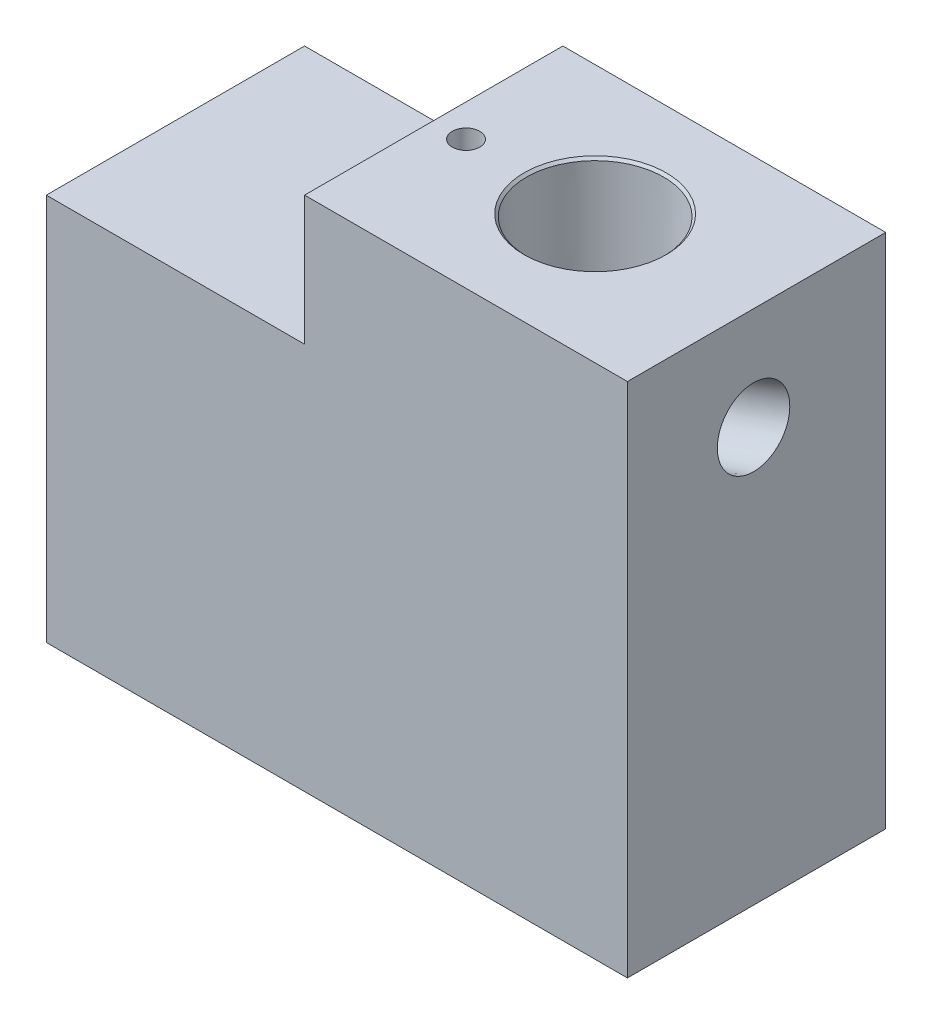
ISO-10303-21;
HEADER;
FILE_DESCRIPTION(('STEP AP214'),'2;1');
FILE_NAME('part.step','',(''),(''),'','','');
FILE_SCHEMA(('AUTOMOTIVE_DESIGN { 1 0 10303 214 1 1 1 1 }'));
ENDSEC;
DATA;
#1=APPLICATION_CONTEXT('core data for automotive mechanical design processes');
#2=APPLICATION_PROTOCOL_DEFINITION('international standard','automotive_design',2000,#1);
#3=PRODUCT_CONTEXT('',#1,'mechanical');
#4=PRODUCT('Part','Part','',(#3));
#5=PRODUCT_RELATED_PRODUCT_CATEGORY('part','',(#4));
#6=PRODUCT_DEFINITION_FORMATION('','',#4);
#7=PRODUCT_DEFINITION_CONTEXT('part definition',#1,'design');
#8=PRODUCT_DEFINITION('design','',#6,#7);
#9=PRODUCT_DEFINITION_SHAPE('','',#8);
#10=(LENGTH_UNIT() NAMED_UNIT(*) SI_UNIT(.MILLI.,.METRE.));
#11=(NAMED_UNIT(*) PLANE_ANGLE_UNIT() SI_UNIT($,.RADIAN.));
#12=(NAMED_UNIT(*) SI_UNIT($,.STERADIAN.) SOLID_ANGLE_UNIT());
#13=UNCERTAINTY_MEASURE_WITH_UNIT(LENGTH_MEASURE(1.E-05),#10,'distance_accuracy_value','');
#14=(GEOMETRIC_REPRESENTATION_CONTEXT(3) GLOBAL_UNCERTAINTY_ASSIGNED_CONTEXT((#13)) GLOBAL_UNIT_ASSIGNED_CONTEXT((#10,
#11,#12)) REPRESENTATION_CONTEXT('',''));
#15=CARTESIAN_POINT('',(0.,0.,0.));
#16=DIRECTION('',(0.,0.,1.));
#17=DIRECTION('',(1.,0.,0.));
#18=AXIS2_PLACEMENT_3D('',#15,#16,#17);
#19=CARTESIAN_POINT('',(82.55,71.12,-25.4));
#20=DIRECTION('',(0.,1.,0.));
#21=DIRECTION('',(0.,0.,1.));
#22=AXIS2_PLACEMENT_3D('',#19,#20,#21);
#23=CONICAL_SURFACE('',#22,11.5062,1.02974425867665);
#24=CARTESIAN_POINT('',(82.55,71.12,-25.4));
#25=DIRECTION('',(0.,1.,0.));
#26=DIRECTION('',(0.,0.,1.));
#27=AXIS2_PLACEMENT_3D('',#24,#25,#26);
#28=CIRCLE('',#27,11.5062);
#29=CARTESIAN_POINT('',(71.4041541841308,71.12,-22.5429456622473));
#30=VERTEX_POINT('',#29);
#31=CARTESIAN_POINT('',(92.5331593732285,71.12,-19.6790588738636));
#32=VERTEX_POINT('',#31);
#33=EDGE_CURVE('E288',#30,#32,#28,.T.);
#34=ORIENTED_EDGE('',*,*,#33,.T.);
#35=CARTESIAN_POINT('',(92.533528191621,71.1202,-19.6790330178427));
#36=CARTESIAN_POINT('',(92.3308237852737,71.0102910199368,-19.6932346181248));
#37=CARTESIAN_POINT('',(92.127904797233,70.9008022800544,-19.707644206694));
#38=CARTESIAN_POINT('',(91.7215059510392,70.6828854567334,-19.7366986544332));
#39=CARTESIAN_POINT('',(91.5180260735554,70.5744574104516,-19.751343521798));
#40=CARTESIAN_POINT('',(91.1101066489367,70.3587411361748,-19.7807070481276));
#41=CARTESIAN_POINT('',(90.9056661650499,70.251454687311,-19.7954257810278));
#42=CARTESIAN_POINT('',(90.4959370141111,70.0384903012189,-19.8246557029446));
#43=CARTESIAN_POINT('',(90.2906483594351,69.9328123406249,-19.8391668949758));
#44=CARTESIAN_POINT('',(89.8673398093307,69.7175483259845,-19.8684414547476));
#45=CARTESIAN_POINT('',(89.6492575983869,69.6080800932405,-19.8831725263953));
#46=CARTESIAN_POINT('',(89.2115685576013,69.3920814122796,-19.9114526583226));
#47=CARTESIAN_POINT('',(88.9919617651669,69.2855508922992,-19.9250017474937));
#48=CARTESIAN_POINT('',(88.5508578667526,69.0764184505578,-19.9501344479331));
#49=CARTESIAN_POINT('',(88.3293614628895,68.9738151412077,-19.9617187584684));
#50=CARTESIAN_POINT('',(87.8838763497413,68.7738874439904,-19.9818523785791));
#51=CARTESIAN_POINT('',(87.6598879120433,68.6765624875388,-19.990402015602));
#52=CARTESIAN_POINT('',(87.1712349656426,68.4735661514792,-20.0040787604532));
#53=CARTESIAN_POINT('',(86.9059967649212,68.369195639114,-20.0084009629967));
#54=CARTESIAN_POINT('',(86.3701982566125,68.1748663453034,-20.0080178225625));
#55=CARTESIAN_POINT('',(86.0996383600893,68.0849064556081,-20.0033131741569));
#56=CARTESIAN_POINT('',(85.5580348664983,67.9273427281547,-19.9818442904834));
#57=CARTESIAN_POINT('',(85.2871045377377,67.8593355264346,-19.9653180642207));
#58=CARTESIAN_POINT('',(84.8776968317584,67.7770869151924,-19.9306573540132));
#59=CARTESIAN_POINT('',(84.7407525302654,67.7529671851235,-19.9174620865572));
#60=CARTESIAN_POINT('',(84.4661405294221,67.7118278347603,-19.8879758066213));
#61=CARTESIAN_POINT('',(84.3284729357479,67.6948072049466,-19.8716852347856));
#62=CARTESIAN_POINT('',(84.0513139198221,67.6679939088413,-19.8362319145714));
#63=CARTESIAN_POINT('',(83.9118186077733,67.6582795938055,-19.8170406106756));
#64=CARTESIAN_POINT('',(83.6328105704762,67.6462903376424,-19.776598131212));
#65=CARTESIAN_POINT('',(83.4932978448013,67.6440156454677,-19.7553468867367));
#66=CARTESIAN_POINT('',(83.2144279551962,67.646501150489,-19.7116047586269));
#67=CARTESIAN_POINT('',(83.0750709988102,67.6512668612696,-19.6891129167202));
#68=CARTESIAN_POINT('',(82.7967734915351,67.667213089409,-19.6437777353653));
#69=CARTESIAN_POINT('',(82.6578330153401,67.6783946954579,-19.620934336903));
#70=CARTESIAN_POINT('',(82.2383705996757,67.7207892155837,-19.5526185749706));
#71=CARTESIAN_POINT('',(81.9585971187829,67.7607886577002,-19.5079336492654));
#72=CARTESIAN_POINT('',(81.4010255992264,67.8578927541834,-19.4263447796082));
#73=CARTESIAN_POINT('',(81.123227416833,67.9149961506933,-19.3894402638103));
#74=CARTESIAN_POINT('',(80.6462604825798,68.0238243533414,-19.3357740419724));
#75=CARTESIAN_POINT('',(80.4467230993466,68.0726239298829,-19.3162648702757));
#76=CARTESIAN_POINT('',(80.0483584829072,68.1752027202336,-19.2841541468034));
#77=CARTESIAN_POINT('',(79.8495312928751,68.2289822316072,-19.2715530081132));
#78=CARTESIAN_POINT('',(79.4525535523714,68.3404091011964,-19.2539736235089));
#79=CARTESIAN_POINT('',(79.2544032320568,68.3980576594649,-19.2489977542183));
#80=CARTESIAN_POINT('',(78.8589486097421,68.5163199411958,-19.247218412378));
#81=CARTESIAN_POINT('',(78.6616443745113,68.5769338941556,-19.2504155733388));
#82=CARTESIAN_POINT('',(78.0729713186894,68.7615642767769,-19.2728886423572));
#83=CARTESIAN_POINT('',(77.6830340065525,68.8888902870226,-19.3049577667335));
#84=CARTESIAN_POINT('',(76.9096066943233,69.1477890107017,-19.4063502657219));
#85=CARTESIAN_POINT('',(76.526113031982,69.2793591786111,-19.4756516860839));
#86=CARTESIAN_POINT('',(75.9145592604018,69.4924704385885,-19.6201610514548));
#87=CARTESIAN_POINT('',(75.6834282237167,69.5737972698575,-19.6828534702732));
#88=CARTESIAN_POINT('',(75.2259894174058,69.7359215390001,-19.8243563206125));
#89=CARTESIAN_POINT('',(74.9996803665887,69.8167191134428,-19.9031624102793));
#90=CARTESIAN_POINT('',(74.553101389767,69.9769963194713,-20.0779084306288));
#91=CARTESIAN_POINT('',(74.3328348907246,70.0564751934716,-20.1738578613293));
#92=CARTESIAN_POINT('',(73.9003019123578,70.2131007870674,-20.3839387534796));
#93=CARTESIAN_POINT('',(73.6880329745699,70.290248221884,-20.4980645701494));
#94=CARTESIAN_POINT('',(73.3287921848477,70.421062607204,-20.7128580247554));
#95=CARTESIAN_POINT('',(73.1794449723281,70.4755261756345,-20.809055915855));
#96=CARTESIAN_POINT('',(72.8875397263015,70.5820289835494,-21.012385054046));
#97=CARTESIAN_POINT('',(72.7449824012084,70.6340679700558,-21.1195174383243));
#98=CARTESIAN_POINT('',(72.3306159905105,70.7852402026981,-21.4573291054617));
#99=CARTESIAN_POINT('',(72.0705193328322,70.8800111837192,-21.7053475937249));
#100=CARTESIAN_POINT('',(71.7572561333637,70.9933272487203,-22.0662138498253));
#101=CARTESIAN_POINT('',(71.682377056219,71.020338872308,-22.1580494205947));
#102=CARTESIAN_POINT('',(71.5384275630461,71.0720710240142,-22.3469865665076));
#103=CARTESIAN_POINT('',(71.4693655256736,71.0967882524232,-22.4440954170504));
#104=CARTESIAN_POINT('',(71.4035923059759,71.1202,-22.5437972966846));
#105=B_SPLINE_CURVE_WITH_KNOTS('',3,(#35,#36,#37,#38,#39,#40,#41,#42,#43,#44,#45,#46,#47,#48,
#49,#50,#51,#52,#53,#54,#55,#56,#57,#58,#59,#60,#61,#62,#63,#64,#65,#66,#67,#68,#69,#70,#71,#72,
#73,#74,#75,#76,#77,#78,#79,#80,#81,#82,#83,#84,#85,#86,#87,#88,#89,#90,#91,#92,#93,#94,#95,#96,
#97,#98,#99,#100,#101,#102,#103,#104),.UNSPECIFIED.,.F.,.F.,(4,2,2,2,2,2,2,2,2,2,2,2,2,2,2,2,2,
2,2,2,2,2,2,2,2,2,2,2,2,2,2,2,2,2,4),(0.,0.693064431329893,1.38615305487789,2.08019799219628,
2.77423283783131,3.50759084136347,4.24093091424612,4.97400944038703,5.7070088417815,
6.56182327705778,7.416571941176,8.25457913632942,8.67341958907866,9.09220046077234,
9.51541060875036,9.93863491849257,10.3621908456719,10.7858186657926,11.6433546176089,
12.500827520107,13.1196857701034,13.7385810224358,14.3576691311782,14.9768052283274,
16.2094447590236,17.4413582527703,18.1996233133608,18.9576843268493,19.7161667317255,
20.4744140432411,21.03137667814,21.5883972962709,22.6966907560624,23.0610745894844,
23.4259745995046),.UNSPECIFIED.);
#106=EDGE_CURVE('E235',#32,#30,#105,.T.);
#107=ORIENTED_EDGE('',*,*,#106,.T.);
#108=EDGE_LOOP('',(#34,#107));
#109=FACE_BOUND('',#108,.T.);
#110=ADVANCED_FACE('F36',(#109),#23,.F.);
#111=CARTESIAN_POINT('',(57.15,58.42,-25.4));
#112=DIRECTION('',(0.,-1.,0.));
#113=DIRECTION('',(0.,0.,-1.));
#114=AXIS2_PLACEMENT_3D('',#111,#112,#113);
#115=CONICAL_SURFACE('',#114,7.1374,1.02974425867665);
#116=CARTESIAN_POINT('',(57.15,58.42,-25.4));
#117=DIRECTION('',(0.,-1.,0.));
#118=DIRECTION('',(0.,0.,-1.));
#119=AXIS2_PLACEMENT_3D('',#116,#117,#118);
#120=CIRCLE('',#119,7.1374);
#121=CARTESIAN_POINT('',(62.5977054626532,58.42,-20.7886028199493));
#122=VERTEX_POINT('',#121);
#123=CARTESIAN_POINT('',(53.4539098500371,58.42,-19.2941506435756));
#124=VERTEX_POINT('',#123);
#125=EDGE_CURVE('E336',#122,#124,#120,.T.);
#126=ORIENTED_EDGE('',*,*,#125,.T.);
#127=CARTESIAN_POINT('',(53.4532734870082,58.4198,-19.2941467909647));
#128=CARTESIAN_POINT('',(53.6075642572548,58.4682932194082,-19.2950880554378));
#129=CARTESIAN_POINT('',(53.7624509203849,58.5149280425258,-19.2962821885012));
#130=CARTESIAN_POINT('',(54.0734543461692,58.6040155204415,-19.2993314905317));
#131=CARTESIAN_POINT('',(54.2295713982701,58.6464671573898,-19.3011868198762));
#132=CARTESIAN_POINT('',(54.5432561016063,58.726764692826,-19.305717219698));
#133=CARTESIAN_POINT('',(54.7008257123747,58.7646029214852,-19.3083936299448));
#134=CARTESIAN_POINT('',(55.0170759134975,58.8351241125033,-19.3147869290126));
#135=CARTESIAN_POINT('',(55.1757564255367,58.8678074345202,-19.3185037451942));
#136=CARTESIAN_POINT('',(55.6534730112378,58.957482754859,-19.3316100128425));
#137=CARTESIAN_POINT('',(55.9741005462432,59.0060782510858,-19.3429543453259));
#138=CARTESIAN_POINT('',(56.6175462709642,59.0784813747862,-19.3737074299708));
#139=CARTESIAN_POINT('',(56.9403626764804,59.1023072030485,-19.3931102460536));
#140=CARTESIAN_POINT('',(57.5883329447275,59.1253805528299,-19.4437755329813));
#141=CARTESIAN_POINT('',(57.9134866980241,59.1244476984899,-19.4751233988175));
#142=CARTESIAN_POINT('',(58.5611931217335,59.1001373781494,-19.55360804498));
#143=CARTESIAN_POINT('',(58.8837443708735,59.0767483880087,-19.6007529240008));
#144=CARTESIAN_POINT('',(59.5222522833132,59.0118399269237,-19.7143559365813));
#145=CARTESIAN_POINT('',(59.8382299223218,58.970392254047,-19.7807372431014));
#146=CARTESIAN_POINT('',(60.4622713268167,58.8740476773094,-19.9362621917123));
#147=CARTESIAN_POINT('',(60.7703396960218,58.8191588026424,-20.0253922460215));
#148=CARTESIAN_POINT('',(61.33672225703,58.708107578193,-20.2164632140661));
#149=CARTESIAN_POINT('',(61.5963069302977,58.6530338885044,-20.3152428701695));
#150=CARTESIAN_POINT('',(61.978150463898,58.5673891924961,-20.4799345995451));
#151=CARTESIAN_POINT('',(62.1043063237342,58.5383026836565,-20.5376558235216));
#152=CARTESIAN_POINT('',(62.3537044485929,58.4794627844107,-20.6589166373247));
#153=CARTESIAN_POINT('',(62.4769453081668,58.4497090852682,-20.7224589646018));
#154=CARTESIAN_POINT('',(62.598518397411,58.4198,-20.7890480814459));
#155=B_SPLINE_CURVE_WITH_KNOTS('',3,(#127,#128,#129,#130,#131,#132,#133,#134,#135,#136,#137,
#138,#139,#140,#141,#142,#143,#144,#145,#146,#147,#148,#149,#150,#151,#152,#153,#154),
.UNSPECIFIED.,.F.,.F.,(4,2,2,2,2,2,2,2,2,2,2,2,2,4),(0.,0.485210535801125,0.970538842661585,
1.45666331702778,1.94275385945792,2.91519359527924,3.88691827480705,4.86572424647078,
5.84503279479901,6.82048281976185,7.79535156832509,8.64377074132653,9.06888633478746,
9.4942028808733),.UNSPECIFIED.);
#156=EDGE_CURVE('E11',#124,#122,#155,.T.);
#157=ORIENTED_EDGE('',*,*,#156,.T.);
#158=EDGE_LOOP('',(#126,#157));
#159=FACE_BOUND('',#158,.T.);
#160=ADVANCED_FACE('F275',(#159),#115,.F.);
#161=CARTESIAN_POINT('',(0.,101.6,0.));
#162=DIRECTION('',(1.,0.,0.));
#163=DIRECTION('',(0.,0.,-1.));
#164=AXIS2_PLACEMENT_3D('',#161,#162,#163);
#165=PLANE('',#164);
#166=DIRECTION('',(0.,-1.,0.));
#167=VECTOR('',#166,1.);
#168=CARTESIAN_POINT('',(0.,101.6,0.));
#169=LINE('',#168,#167);
#170=CARTESIAN_POINT('',(0.,76.2,0.));
#171=VERTEX_POINT('',#170);
#172=CARTESIAN_POINT('',(0.,0.,0.));
#173=VERTEX_POINT('',#172);
#174=EDGE_CURVE('E323',#171,#173,#169,.T.);
#175=ORIENTED_EDGE('',*,*,#174,.F.);
#176=DIRECTION('',(0.,0.,1.));
#177=VECTOR('',#176,1.);
#178=CARTESIAN_POINT('',(0.,76.2,0.));
#179=LINE('',#178,#177);
#180=CARTESIAN_POINT('',(0.,76.2,-50.8));
#181=VERTEX_POINT('',#180);
#182=EDGE_CURVE('E429',#181,#171,#179,.T.);
#183=ORIENTED_EDGE('',*,*,#182,.F.);
#184=DIRECTION('',(0.,-1.,0.));
#185=VECTOR('',#184,1.);
#186=CARTESIAN_POINT('',(0.,101.6,-50.8));
#187=LINE('',#186,#185);
#188=CARTESIAN_POINT('',(0.,0.,-50.8));
#189=VERTEX_POINT('',#188);
#190=EDGE_CURVE('E308',#181,#189,#187,.T.);
#191=ORIENTED_EDGE('',*,*,#190,.T.);
#192=DIRECTION('',(0.,0.,1.));
#193=VECTOR('',#192,1.);
#194=CARTESIAN_POINT('',(0.,0.,0.));
#195=LINE('',#194,#193);
#196=EDGE_CURVE('E294',#189,#173,#195,.T.);
#197=ORIENTED_EDGE('',*,*,#196,.T.);
#198=EDGE_LOOP('',(#175,#183,#191,#197));
#199=FACE_BOUND('',#198,.T.);
#200=ADVANCED_FACE('F38',(#199),#165,.F.);
#201=CARTESIAN_POINT('',(0.,101.6,0.));
#202=DIRECTION('',(0.,0.,-1.));
#203=DIRECTION('',(-1.,0.,0.));
#204=AXIS2_PLACEMENT_3D('',#201,#202,#203);
#205=PLANE('',#204);
#206=DIRECTION('',(1.,0.,0.));
#207=VECTOR('',#206,1.);
#208=CARTESIAN_POINT('',(0.,101.6,0.));
#209=LINE('',#208,#207);
#210=CARTESIAN_POINT('',(50.8,101.6,0.));
#211=VERTEX_POINT('',#210);
#212=CARTESIAN_POINT('',(114.3,101.6,0.));
#213=VERTEX_POINT('',#212);
#214=EDGE_CURVE('E300',#211,#213,#209,.T.);
#215=ORIENTED_EDGE('',*,*,#214,.F.);
#216=DIRECTION('',(0.,1.,0.));
#217=VECTOR('',#216,1.);
#218=CARTESIAN_POINT('',(50.8,76.2,0.));
#219=LINE('',#218,#217);
#220=CARTESIAN_POINT('',(50.8,76.2,0.));
#221=VERTEX_POINT('',#220);
#222=EDGE_CURVE('E395',#221,#211,#219,.T.);
#223=ORIENTED_EDGE('',*,*,#222,.F.);
#224=DIRECTION('',(1.,0.,0.));
#225=VECTOR('',#224,1.);
#226=CARTESIAN_POINT('',(0.,76.2,0.));
#227=LINE('',#226,#225);
#228=EDGE_CURVE('E432',#171,#221,#227,.T.);
#229=ORIENTED_EDGE('',*,*,#228,.F.);
#230=ORIENTED_EDGE('',*,*,#174,.T.);
#231=DIRECTION('',(1.,0.,0.));
#232=VECTOR('',#231,1.);
#233=CARTESIAN_POINT('',(0.,0.,0.));
#234=LINE('',#233,#232);
#235=CARTESIAN_POINT('',(114.3,0.,0.));
#236=VERTEX_POINT('',#235);
#237=EDGE_CURVE('E311',#173,#236,#234,.T.);
#238=ORIENTED_EDGE('',*,*,#237,.T.);
#239=DIRECTION('',(0.,-1.,0.));
#240=VECTOR('',#239,1.);
#241=CARTESIAN_POINT('',(114.3,101.6,0.));
#242=LINE('',#241,#240);
#243=EDGE_CURVE('E321',#213,#236,#242,.T.);
#244=ORIENTED_EDGE('',*,*,#243,.F.);
#245=EDGE_LOOP('',(#215,#223,#229,#230,#238,#244));
#246=FACE_BOUND('',#245,.T.);
#247=ADVANCED_FACE('F268',(#246),#205,.F.);
#248=CARTESIAN_POINT('',(114.3,101.6,0.));
#249=DIRECTION('',(-1.,0.,0.));
#250=DIRECTION('',(0.,0.,1.));
#251=AXIS2_PLACEMENT_3D('',#248,#249,#250);
#252=PLANE('',#251);
#253=CARTESIAN_POINT('',(114.3,81.4099939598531,-24.8105633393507));
#254=DIRECTION('',(-1.,0.,0.));
#255=DIRECTION('',(0.,1.,0.));
#256=AXIS2_PLACEMENT_3D('',#253,#254,#255);
#257=ELLIPSE('',#256,7.57775488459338,7.12033749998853);
#258=CARTESIAN_POINT('',(114.3,88.9877488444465,-24.8105633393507));
#259=VERTEX_POINT('',#258);
#260=EDGE_CURVE('E40',#259,#259,#257,.T.);
#261=ORIENTED_EDGE('',*,*,#260,.T.);
#262=EDGE_LOOP('',(#261));
#263=FACE_BOUND('',#262,.T.);
#264=DIRECTION('',(0.,0.,-1.));
#265=VECTOR('',#264,1.);
#266=CARTESIAN_POINT('',(114.3,0.,0.));
#267=LINE('',#266,#265);
#268=CARTESIAN_POINT('',(114.3,0.,-50.8));
#269=VERTEX_POINT('',#268);
#270=EDGE_CURVE('E313',#236,#269,#267,.T.);
#271=ORIENTED_EDGE('',*,*,#270,.T.);
#272=DIRECTION('',(0.,-1.,0.));
#273=VECTOR('',#272,1.);
#274=CARTESIAN_POINT('',(114.3,101.6,-50.8));
#275=LINE('',#274,#273);
#276=CARTESIAN_POINT('',(114.3,101.6,-50.8));
#277=VERTEX_POINT('',#276);
#278=EDGE_CURVE('E318',#277,#269,#275,.T.);
#279=ORIENTED_EDGE('',*,*,#278,.F.);
#280=DIRECTION('',(0.,0.,-1.));
#281=VECTOR('',#280,1.);
#282=CARTESIAN_POINT('',(114.3,101.6,0.));
#283=LINE('',#282,#281);
#284=EDGE_CURVE('E302',#213,#277,#283,.T.);
#285=ORIENTED_EDGE('',*,*,#284,.F.);
#286=ORIENTED_EDGE('',*,*,#243,.T.);
#287=EDGE_LOOP('',(#271,#279,#285,#286));
#288=FACE_BOUND('',#287,.T.);
#289=ADVANCED_FACE('F265',(#263,#288),#252,.F.);
#290=CARTESIAN_POINT('',(0.,101.6,-50.8));
#291=DIRECTION('',(0.,0.,1.));
#292=DIRECTION('',(1.,0.,0.));
#293=AXIS2_PLACEMENT_3D('',#290,#291,#292);
#294=PLANE('',#293);
#295=DIRECTION('',(-1.,0.,0.));
#296=VECTOR('',#295,1.);
#297=CARTESIAN_POINT('',(0.,76.2,-50.8));
#298=LINE('',#297,#296);
#299=CARTESIAN_POINT('',(50.8,76.2,-50.8));
#300=VERTEX_POINT('',#299);
#301=EDGE_CURVE('E391',#300,#181,#298,.T.);
#302=ORIENTED_EDGE('',*,*,#301,.F.);
#303=DIRECTION('',(0.,1.,0.));
#304=VECTOR('',#303,1.);
#305=CARTESIAN_POINT('',(50.8,76.2,-50.8));
#306=LINE('',#305,#304);
#307=CARTESIAN_POINT('',(50.8,101.6,-50.8));
#308=VERTEX_POINT('',#307);
#309=EDGE_CURVE('E389',#300,#308,#306,.T.);
#310=ORIENTED_EDGE('',*,*,#309,.T.);
#311=DIRECTION('',(-1.,0.,0.));
#312=VECTOR('',#311,1.);
#313=CARTESIAN_POINT('',(0.,101.6,-50.8));
#314=LINE('',#313,#312);
#315=EDGE_CURVE('E305',#277,#308,#314,.T.);
#316=ORIENTED_EDGE('',*,*,#315,.F.);
#317=ORIENTED_EDGE('',*,*,#278,.T.);
#318=DIRECTION('',(-1.,0.,0.));
#319=VECTOR('',#318,1.);
#320=CARTESIAN_POINT('',(0.,0.,-50.8));
#321=LINE('',#320,#319);
#322=EDGE_CURVE('E303',#269,#189,#321,.T.);
#323=ORIENTED_EDGE('',*,*,#322,.T.);
#324=ORIENTED_EDGE('',*,*,#190,.F.);
#325=EDGE_LOOP('',(#302,#310,#316,#317,#323,#324));
#326=FACE_BOUND('',#325,.T.);
#327=ADVANCED_FACE('F258',(#326),#294,.F.);
#328=CARTESIAN_POINT('',(0.,101.6,0.));
#329=DIRECTION('',(0.,-1.,0.));
#330=DIRECTION('',(0.,0.,-1.));
#331=AXIS2_PLACEMENT_3D('',#328,#329,#330);
#332=PLANE('',#331);
#333=CARTESIAN_POINT('',(57.15,101.6,-25.4));
#334=DIRECTION('',(0.,1.,0.));
#335=DIRECTION('',(0.,0.,1.));
#336=AXIS2_PLACEMENT_3D('',#333,#334,#335);
#337=CIRCLE('',#336,2.70509999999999);
#338=CARTESIAN_POINT('',(57.15,101.6,-22.6949));
#339=VERTEX_POINT('',#338);
#340=EDGE_CURVE('E770',#339,#339,#337,.T.);
#341=ORIENTED_EDGE('',*,*,#340,.F.);
#342=EDGE_LOOP('',(#341));
#343=FACE_BOUND('',#342,.T.);
#344=CARTESIAN_POINT('',(82.55,101.6,-25.4));
#345=DIRECTION('',(0.,1.,0.));
#346=DIRECTION('',(0.,0.,1.));
#347=AXIS2_PLACEMENT_3D('',#344,#345,#346);
#348=CIRCLE('',#347,13.97);
#349=CARTESIAN_POINT('',(82.55,101.6,-11.43));
#350=VERTEX_POINT('',#349);
#351=EDGE_CURVE('E359',#350,#350,#348,.T.);
#352=ORIENTED_EDGE('',*,*,#351,.F.);
#353=EDGE_LOOP('',(#352));
#354=FACE_BOUND('',#353,.T.);
#355=ORIENTED_EDGE('',*,*,#315,.T.);
#356=DIRECTION('',(0.,0.,-1.));
#357=VECTOR('',#356,1.);
#358=CARTESIAN_POINT('',(50.8,101.6,0.));
#359=LINE('',#358,#357);
#360=EDGE_CURVE('E383',#211,#308,#359,.T.);
#361=ORIENTED_EDGE('',*,*,#360,.F.);
#362=ORIENTED_EDGE('',*,*,#214,.T.);
#363=ORIENTED_EDGE('',*,*,#284,.T.);
#364=EDGE_LOOP('',(#355,#361,#362,#363));
#365=FACE_BOUND('',#364,.T.);
#366=ADVANCED_FACE('F254',(#343,#354,#365),#332,.F.);
#367=CARTESIAN_POINT('',(0.,0.,0.));
#368=DIRECTION('',(0.,-1.,0.));
#369=DIRECTION('',(0.,0.,-1.));
#370=AXIS2_PLACEMENT_3D('',#367,#368,#369);
#371=PLANE('',#370);
#372=CARTESIAN_POINT('',(9.03974866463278,0.,-42.6720000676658));
#373=DIRECTION('',(0.,-1.,0.));
#374=DIRECTION('',(0.,0.,-1.));
#375=AXIS2_PLACEMENT_3D('',#372,#373,#374);
#376=CIRCLE('',#375,2.0193);
#377=CARTESIAN_POINT('',(9.03974866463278,0.,-44.6913000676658));
#378=VERTEX_POINT('',#377);
#379=EDGE_CURVE('E138',#378,#378,#376,.T.);
#380=ORIENTED_EDGE('',*,*,#379,.F.);
#381=EDGE_LOOP('',(#380));
#382=FACE_BOUND('',#381,.T.);
#383=CARTESIAN_POINT('',(9.03974861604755,0.,-8.12800006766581));
#384=DIRECTION('',(0.,-1.,0.));
#385=DIRECTION('',(0.,0.,-1.));
#386=AXIS2_PLACEMENT_3D('',#383,#384,#385);
#387=CIRCLE('',#386,2.0193);
#388=CARTESIAN_POINT('',(9.03974861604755,0.,-10.1473000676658));
#389=VERTEX_POINT('',#388);
#390=EDGE_CURVE('E137',#389,#389,#387,.T.);
#391=ORIENTED_EDGE('',*,*,#390,.F.);
#392=EDGE_LOOP('',(#391));
#393=FACE_BOUND('',#392,.T.);
#394=CARTESIAN_POINT('',(102.362968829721,0.,-38.0999999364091));
#395=DIRECTION('',(0.,-1.,0.));
#396=DIRECTION('',(0.,0.,-1.));
#397=AXIS2_PLACEMENT_3D('',#394,#395,#396);
#398=CIRCLE('',#397,2.0193);
#399=CARTESIAN_POINT('',(102.362968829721,0.,-40.1192999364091));
#400=VERTEX_POINT('',#399);
#401=EDGE_CURVE('E148',#400,#400,#398,.T.);
#402=ORIENTED_EDGE('',*,*,#401,.F.);
#403=EDGE_LOOP('',(#402));
#404=FACE_BOUND('',#403,.T.);
#405=CARTESIAN_POINT('',(102.362968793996,0.,-12.6999999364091));
#406=DIRECTION('',(0.,-1.,0.));
#407=DIRECTION('',(0.,0.,-1.));
#408=AXIS2_PLACEMENT_3D('',#405,#406,#407);
#409=CIRCLE('',#408,2.0193);
#410=CARTESIAN_POINT('',(102.362968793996,0.,-14.7192999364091));
#411=VERTEX_POINT('',#410);
#412=EDGE_CURVE('E154',#411,#411,#409,.T.);
#413=ORIENTED_EDGE('',*,*,#412,.F.);
#414=EDGE_LOOP('',(#413));
#415=FACE_BOUND('',#414,.T.);
#416=CARTESIAN_POINT('',(57.15,0.,-25.4));
#417=DIRECTION('',(0.,-1.,0.));
#418=DIRECTION('',(0.,0.,-1.));
#419=AXIS2_PLACEMENT_3D('',#416,#417,#418);
#420=CIRCLE('',#419,9.14399999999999);
#421=CARTESIAN_POINT('',(57.15,0.,-34.544));
#422=VERTEX_POINT('',#421);
#423=EDGE_CURVE('E394',#422,#422,#420,.T.);
#424=ORIENTED_EDGE('',*,*,#423,.F.);
#425=EDGE_LOOP('',(#424));
#426=FACE_BOUND('',#425,.T.);
#427=CARTESIAN_POINT('',(25.4,0.,-25.4));
#428=DIRECTION('',(0.,-1.,0.));
#429=DIRECTION('',(0.,0.,-1.));
#430=AXIS2_PLACEMENT_3D('',#427,#428,#429);
#431=CIRCLE('',#430,9.144);
#432=CARTESIAN_POINT('',(25.4,0.,-34.544));
#433=VERTEX_POINT('',#432);
#434=EDGE_CURVE('E339',#433,#433,#431,.T.);
#435=ORIENTED_EDGE('',*,*,#434,.F.);
#436=EDGE_LOOP('',(#435));
#437=FACE_BOUND('',#436,.T.);
#438=ORIENTED_EDGE('',*,*,#196,.F.);
#439=ORIENTED_EDGE('',*,*,#322,.F.);
#440=ORIENTED_EDGE('',*,*,#270,.F.);
#441=ORIENTED_EDGE('',*,*,#237,.F.);
#442=EDGE_LOOP('',(#438,#439,#440,#441));
#443=FACE_BOUND('',#442,.T.);
#444=ADVANCED_FACE('F252',(#382,#393,#404,#415,#426,#437,#443),#371,.T.);
#445=CARTESIAN_POINT('',(93.1622585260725,71.12,-29.8466400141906));
#446=VERTEX_POINT('',#445);
#447=CARTESIAN_POINT('',(71.136966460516,71.1200000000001,-26.8612678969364));
#448=VERTEX_POINT('',#447);
#449=EDGE_CURVE('E290',#446,#448,#28,.T.);
#450=ORIENTED_EDGE('',*,*,#449,.T.);
#451=CARTESIAN_POINT('',(71.1365210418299,71.1202,-26.8604096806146));
#452=CARTESIAN_POINT('',(71.2120575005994,71.0862834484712,-27.0059770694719));
#453=CARTESIAN_POINT('',(71.2949257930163,71.0494857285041,-27.1467783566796));
#454=CARTESIAN_POINT('',(71.4731687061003,70.9710039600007,-27.4183158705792));
#455=CARTESIAN_POINT('',(71.5685139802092,70.9293314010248,-27.5490746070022));
#456=CARTESIAN_POINT('',(71.868227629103,70.799093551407,-27.9234725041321));
#457=CARTESIAN_POINT('',(72.0881633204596,70.7044642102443,-28.1526965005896));
#458=CARTESIAN_POINT('',(72.4766079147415,70.5384735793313,-28.5008199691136));
#459=CARTESIAN_POINT('',(72.637031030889,70.4702015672,-28.6306632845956));
#460=CARTESIAN_POINT('',(72.9679418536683,70.32985970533,-28.8746241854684));
#461=CARTESIAN_POINT('',(73.1384308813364,70.2577893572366,-28.9887397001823));
#462=CARTESIAN_POINT('',(73.4883145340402,70.1103136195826,-29.202543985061));
#463=CARTESIAN_POINT('',(73.667755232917,70.0348912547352,-29.3021448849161));
#464=CARTESIAN_POINT('',(74.0329678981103,69.8817920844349,-29.4869085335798));
#465=CARTESIAN_POINT('',(74.2187403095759,69.8041151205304,-29.5720702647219));
#466=CARTESIAN_POINT('',(74.6713189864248,69.6153646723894,-29.7602626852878));
#467=CARTESIAN_POINT('',(74.9405645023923,69.5034675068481,-29.8566293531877));
#468=CARTESIAN_POINT('',(75.4860458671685,69.2776427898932,-30.0238816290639));
#469=CARTESIAN_POINT('',(75.7622842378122,69.1637145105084,-30.0947579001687));
#470=CARTESIAN_POINT('',(76.3192143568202,68.9350767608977,-30.2121746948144));
#471=CARTESIAN_POINT('',(76.5999015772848,68.8203681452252,-30.2587385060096));
#472=CARTESIAN_POINT('',(77.1641705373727,68.5911475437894,-30.3285426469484));
#473=CARTESIAN_POINT('',(77.447751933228,68.4766355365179,-30.3517857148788));
#474=CARTESIAN_POINT('',(78.0229848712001,68.2463008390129,-30.3759056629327));
#475=CARTESIAN_POINT('',(78.3146710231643,68.1305093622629,-30.3762512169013));
#476=CARTESIAN_POINT('',(78.8983075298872,67.9018471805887,-30.3538225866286));
#477=CARTESIAN_POINT('',(79.190257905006,67.7889767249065,-30.3310464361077));
#478=CARTESIAN_POINT('',(79.773874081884,67.5681158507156,-30.2629687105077));
#479=CARTESIAN_POINT('',(80.0655389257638,67.4601324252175,-30.21763590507));
#480=CARTESIAN_POINT('',(80.502163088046,67.304610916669,-30.1337626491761));
#481=CARTESIAN_POINT('',(80.6475489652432,67.2538492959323,-30.1031618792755));
#482=CARTESIAN_POINT('',(80.9381470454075,67.1551495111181,-30.0369986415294));
#483=CARTESIAN_POINT('',(81.0833592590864,67.1072111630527,-30.001436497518));
#484=CARTESIAN_POINT('',(81.3914021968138,67.0094569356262,-29.9212617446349));
#485=CARTESIAN_POINT('',(81.5542351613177,66.9601177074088,-29.8760746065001));
#486=CARTESIAN_POINT('',(81.8804932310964,66.867897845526,-29.7812472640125));
#487=CARTESIAN_POINT('',(82.0439184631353,66.825018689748,-29.73160604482));
#488=CARTESIAN_POINT('',(82.3711146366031,66.748649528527,-29.6302400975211));
#489=CARTESIAN_POINT('',(82.5348762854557,66.7150998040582,-29.5785311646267));
#490=CARTESIAN_POINT('',(82.8648384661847,66.6607848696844,-29.4760642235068));
#491=CARTESIAN_POINT('',(83.0310373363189,66.6400113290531,-29.4253056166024));
#492=CARTESIAN_POINT('',(83.3176750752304,66.6192776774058,-29.3435957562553));
#493=CARTESIAN_POINT('',(83.4373645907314,66.6150214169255,-29.3111772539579));
#494=CARTESIAN_POINT('',(83.6779132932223,66.6165347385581,-29.2513195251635));
#495=CARTESIAN_POINT('',(83.7987718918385,66.6222995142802,-29.2238779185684));
#496=CARTESIAN_POINT('',(84.0407976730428,66.6442777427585,-29.1755119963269));
#497=CARTESIAN_POINT('',(84.1619646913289,66.6604864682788,-29.1545847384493));
#498=CARTESIAN_POINT('',(84.4036245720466,66.7025761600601,-29.1197574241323));
#499=CARTESIAN_POINT('',(84.5241172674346,66.7284594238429,-29.1058590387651));
#500=CARTESIAN_POINT('',(84.7578754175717,66.7868399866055,-29.0850842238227));
#501=CARTESIAN_POINT('',(84.8712105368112,66.8189609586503,-29.077903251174));
#502=CARTESIAN_POINT('',(85.0963246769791,66.888958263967,-29.068497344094));
#503=CARTESIAN_POINT('',(85.2081028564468,66.9268375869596,-29.066274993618));
#504=CARTESIAN_POINT('',(85.4303086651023,67.0070622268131,-29.0657586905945));
#505=CARTESIAN_POINT('',(85.5407327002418,67.0494173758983,-29.067473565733));
#506=CARTESIAN_POINT('',(85.7601263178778,67.1374390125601,-29.0739182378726));
#507=CARTESIAN_POINT('',(85.869096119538,67.1831049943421,-29.0786475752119));
#508=CARTESIAN_POINT('',(86.0883275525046,67.2780391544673,-29.0904991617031));
#509=CARTESIAN_POINT('',(86.1985605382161,67.3273663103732,-29.0976743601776));
#510=CARTESIAN_POINT('',(86.4179785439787,67.428035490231,-29.113765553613));
#511=CARTESIAN_POINT('',(86.527163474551,67.479377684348,-29.1226816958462));
#512=CARTESIAN_POINT('',(86.8531274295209,67.6355655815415,-29.1512724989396));
#513=CARTESIAN_POINT('',(87.0686345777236,67.7427141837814,-29.1728098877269));
#514=CARTESIAN_POINT('',(87.5421180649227,67.9835550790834,-29.2230572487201));
#515=CARTESIAN_POINT('',(87.7995819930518,68.1181242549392,-29.2523264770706));
#516=CARTESIAN_POINT('',(88.3125519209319,68.3907128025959,-29.3120433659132));
#517=CARTESIAN_POINT('',(88.5680577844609,68.5287324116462,-29.3424911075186));
#518=CARTESIAN_POINT('',(89.0779895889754,68.8071432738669,-29.4033267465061));
#519=CARTESIAN_POINT('',(89.3324147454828,68.94753597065,-29.4337145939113));
#520=CARTESIAN_POINT('',(89.8404704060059,69.2299183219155,-29.4937101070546));
#521=CARTESIAN_POINT('',(90.0941009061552,69.3719079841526,-29.5233177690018));
#522=CARTESIAN_POINT('',(90.5827350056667,69.6468621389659,-29.5792845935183));
#523=CARTESIAN_POINT('',(90.8177744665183,69.7797464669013,-29.6057246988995));
#524=CARTESIAN_POINT('',(91.2875493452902,70.0462875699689,-29.6574103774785));
#525=CARTESIAN_POINT('',(91.5222847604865,70.1799443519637,-29.6826559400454));
#526=CARTESIAN_POINT('',(91.9913657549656,70.4477587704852,-29.7318242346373));
#527=CARTESIAN_POINT('',(92.2257114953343,70.581915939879,-29.7557479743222));
#528=CARTESIAN_POINT('',(92.694254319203,70.8507192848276,-29.8022400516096));
#529=CARTESIAN_POINT('',(92.9284514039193,70.9853654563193,-29.8248084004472));
#530=CARTESIAN_POINT('',(93.1626058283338,71.1202,-29.8466724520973));
#531=B_SPLINE_CURVE_WITH_KNOTS('',3,(#451,#452,#453,#454,#455,#456,#457,#458,#459,#460,#461,
#462,#463,#464,#465,#466,#467,#468,#469,#470,#471,#472,#473,#474,#475,#476,#477,#478,#479,#480,
#481,#482,#483,#484,#485,#486,#487,#488,#489,#490,#491,#492,#493,#494,#495,#496,#497,#498,#499,
#500,#501,#502,#503,#504,#505,#506,#507,#508,#509,#510,#511,#512,#513,#514,#515,#516,#517,#518,
#519,#520,#521,#522,#523,#524,#525,#526,#527,#528,#529,#530),.UNSPECIFIED.,.F.,.F.,(4,2,2,2,2,2,
2,2,2,2,2,2,2,2,2,2,2,2,2,2,2,2,2,2,2,2,2,2,2,2,2,2,2,2,2,2,2,2,2,4),(0.,0.50174998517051,
1.00234035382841,1.9916082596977,2.64305479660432,3.29458701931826,3.94991286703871,
4.60528488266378,5.52521253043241,6.44547679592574,7.36485796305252,8.28413116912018,
9.22472838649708,10.1654055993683,11.1073888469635,11.5783155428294,12.0492115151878,
12.5771810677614,13.1052712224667,13.6298988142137,14.1541839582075,14.5259882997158,
14.8976143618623,15.2690723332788,15.6406185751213,15.9943625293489,16.3482907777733,
16.7030133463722,17.0576818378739,17.420575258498,17.7834993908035,18.5082996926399,
19.3842003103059,20.2601613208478,21.1366758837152,22.0131947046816,22.8270752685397,
23.6409630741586,24.4542216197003,25.2674734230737),.UNSPECIFIED.);
#532=EDGE_CURVE('E220',#448,#446,#531,.T.);
#533=ORIENTED_EDGE('',*,*,#532,.T.);
#534=EDGE_LOOP('',(#450,#533));
#535=FACE_BOUND('',#534,.T.);
#536=ADVANCED_FACE('F245',(#535),#23,.F.);
#537=CARTESIAN_POINT('',(82.55,101.6,-25.4));
#538=DIRECTION('',(0.,1.,0.));
#539=DIRECTION('',(0.,0.,1.));
#540=AXIS2_PLACEMENT_3D('',#537,#538,#539);
#541=CYLINDRICAL_SURFACE('',#540,11.5062);
#542=ORIENTED_EDGE('',*,*,#449,.F.);
#543=CARTESIAN_POINT('',(93.1622585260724,71.12,-29.846640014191));
#544=CARTESIAN_POINT('',(93.1355096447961,71.2549222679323,-29.9104348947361));
#545=CARTESIAN_POINT('',(93.1105154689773,71.3928879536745,-29.9685123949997));
#546=CARTESIAN_POINT('',(93.0646821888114,71.673766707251,-30.0730565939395));
#547=CARTESIAN_POINT('',(93.0438417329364,71.8166781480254,-30.119527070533));
#548=CARTESIAN_POINT('',(93.0070435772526,72.1056108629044,-30.2005022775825));
#549=CARTESIAN_POINT('',(92.9910599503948,72.2516110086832,-30.2350706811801));
#550=CARTESIAN_POINT('',(92.9642053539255,72.546330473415,-30.2926455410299));
#551=CARTESIAN_POINT('',(92.9533345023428,72.6950498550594,-30.3156517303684));
#552=CARTESIAN_POINT('',(92.9369044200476,72.9939255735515,-30.3502754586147));
#553=CARTESIAN_POINT('',(92.9313391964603,73.1440800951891,-30.3619058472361));
#554=CARTESIAN_POINT('',(92.9254739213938,73.4449593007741,-30.3741528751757));
#555=CARTESIAN_POINT('',(92.9251759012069,73.5956841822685,-30.3747652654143));
#556=CARTESIAN_POINT('',(92.9319562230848,74.0474082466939,-30.3606385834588));
#557=CARTESIAN_POINT('',(92.9467102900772,74.3479313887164,-30.3299328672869));
#558=CARTESIAN_POINT('',(92.995418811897,74.9623379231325,-30.2258965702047));
#559=CARTESIAN_POINT('',(93.0306964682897,75.2755947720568,-30.1496175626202));
#560=CARTESIAN_POINT('',(93.1162911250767,75.8873034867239,-29.9560187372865));
#561=CARTESIAN_POINT('',(93.1666224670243,76.1857409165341,-29.8386597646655));
#562=CARTESIAN_POINT('',(93.2538609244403,76.6428289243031,-29.6222481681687));
#563=CARTESIAN_POINT('',(93.2876869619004,76.8081542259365,-29.5357653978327));
#564=CARTESIAN_POINT('',(93.3574211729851,77.1309661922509,-29.3499546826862));
#565=CARTESIAN_POINT('',(93.3933297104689,77.2884514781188,-29.2506244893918));
#566=CARTESIAN_POINT('',(93.5024171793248,77.7474083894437,-28.9337153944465));
#567=CARTESIAN_POINT('',(93.5770475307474,78.0358244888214,-28.6970096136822));
#568=CARTESIAN_POINT('',(93.7055308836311,78.5121098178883,-28.2272684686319));
#569=CARTESIAN_POINT('',(93.7605343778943,78.708518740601,-28.0031631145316));
#570=CARTESIAN_POINT('',(93.8608908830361,79.0637892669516,-27.5250456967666));
#571=CARTESIAN_POINT('',(93.9062588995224,79.2227092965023,-27.2710811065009));
#572=CARTESIAN_POINT('',(93.9750579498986,79.4709272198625,-26.7822731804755));
#573=CARTESIAN_POINT('',(94.0009046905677,79.5674622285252,-26.551493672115));
#574=CARTESIAN_POINT('',(94.0292910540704,79.6841835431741,-26.1954720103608));
#575=CARTESIAN_POINT('',(94.03702312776,79.7184150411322,-26.0751275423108));
#576=CARTESIAN_POINT('',(94.0487342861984,79.7770147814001,-25.8318999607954));
#577=CARTESIAN_POINT('',(94.0527148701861,79.8013869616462,-25.7090178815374));
#578=CARTESIAN_POINT('',(94.0567088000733,79.8399507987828,-25.4610853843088));
#579=CARTESIAN_POINT('',(94.0567057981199,79.8541002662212,-25.3360281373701));
#580=CARTESIAN_POINT('',(94.0525773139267,79.8718420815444,-25.0852312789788));
#581=CARTESIAN_POINT('',(94.0484518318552,79.8754344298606,-24.959491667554));
#582=CARTESIAN_POINT('',(94.0360817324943,79.8720547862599,-24.7083552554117));
#583=CARTESIAN_POINT('',(94.0278369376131,79.865082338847,-24.5829584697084));
#584=CARTESIAN_POINT('',(94.0073513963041,79.8407788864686,-24.3335103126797));
#585=CARTESIAN_POINT('',(93.9951107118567,79.823448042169,-24.2094589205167));
#586=CARTESIAN_POINT('',(93.9676932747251,79.7801343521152,-23.9708463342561));
#587=CARTESIAN_POINT('',(93.9527317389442,79.754720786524,-23.8561563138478));
#588=CARTESIAN_POINT('',(93.9197296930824,79.6955127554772,-23.6293974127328));
#589=CARTESIAN_POINT('',(93.9016881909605,79.6617155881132,-23.5173293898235));
#590=CARTESIAN_POINT('',(93.8433944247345,79.5485168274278,-23.1859331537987));
#591=CARTESIAN_POINT('',(93.798959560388,79.4572868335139,-22.9713003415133));
#592=CARTESIAN_POINT('',(93.6828398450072,79.2073028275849,-22.4777718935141));
#593=CARTESIAN_POINT('',(93.6072647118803,79.0360806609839,-22.2061589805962));
#594=CARTESIAN_POINT('',(93.4470980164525,78.6526912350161,-21.6962681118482));
#595=CARTESIAN_POINT('',(93.3624884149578,78.4404413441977,-21.4580591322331));
#596=CARTESIAN_POINT('',(93.2227923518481,78.0684927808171,-21.0980956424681));
#597=CARTESIAN_POINT('',(93.1683743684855,77.9184355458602,-20.9658800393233));
#598=CARTESIAN_POINT('',(93.0601189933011,77.6070564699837,-20.7150563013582));
#599=CARTESIAN_POINT('',(93.0062817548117,77.4457317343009,-20.5964516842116));
#600=CARTESIAN_POINT('',(92.9006417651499,77.1129521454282,-20.372857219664));
#601=CARTESIAN_POINT('',(92.8488419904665,76.9414833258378,-20.2678868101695));
#602=CARTESIAN_POINT('',(92.7488806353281,76.589699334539,-20.0720022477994));
#603=CARTESIAN_POINT('',(92.7007187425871,76.4093849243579,-19.9810868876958));
#604=CARTESIAN_POINT('',(92.609225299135,76.0392859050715,-19.813063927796));
#605=CARTESIAN_POINT('',(92.5659383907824,75.8494337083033,-19.736080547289));
#606=CARTESIAN_POINT('',(92.486382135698,75.4626570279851,-19.5976445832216));
#607=CARTESIAN_POINT('',(92.4501138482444,75.2657314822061,-19.5361943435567));
#608=CARTESIAN_POINT('',(92.3864833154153,74.8665526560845,-19.4300705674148));
#609=CARTESIAN_POINT('',(92.3590973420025,74.664315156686,-19.3853522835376));
#610=CARTESIAN_POINT('',(92.3148946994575,74.2555859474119,-19.3138465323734));
#611=CARTESIAN_POINT('',(92.2980720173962,74.0490967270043,-19.2870488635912));
#612=CARTESIAN_POINT('',(92.2799333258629,73.6989109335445,-19.2582409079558));
#613=CARTESIAN_POINT('',(92.2754120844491,73.5557863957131,-19.2510979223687));
#614=CARTESIAN_POINT('',(92.2724914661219,73.26933075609,-19.2464795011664));
#615=CARTESIAN_POINT('',(92.2740904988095,73.1259997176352,-19.2490015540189));
#616=CARTESIAN_POINT('',(92.283653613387,72.8402806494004,-19.2641458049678));
#617=CARTESIAN_POINT('',(92.2916083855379,72.697891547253,-19.2767532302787));
#618=CARTESIAN_POINT('',(92.3139088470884,72.4149738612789,-19.3123765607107));
#619=CARTESIAN_POINT('',(92.3282528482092,72.2744447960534,-19.3353897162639));
#620=CARTESIAN_POINT('',(92.3677094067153,71.9601004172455,-19.3994164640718));
#621=CARTESIAN_POINT('',(92.3946518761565,71.7871273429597,-19.4435540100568));
#622=CARTESIAN_POINT('',(92.4417822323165,71.5328351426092,-19.5223980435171));
#623=CARTESIAN_POINT('',(92.4586262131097,71.4488742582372,-19.5508104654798));
#624=CARTESIAN_POINT('',(92.4943839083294,71.2829105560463,-19.6118125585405));
#625=CARTESIAN_POINT('',(92.5132981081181,71.2009082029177,-19.6444032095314));
#626=CARTESIAN_POINT('',(92.5331593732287,71.1200000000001,-19.6790588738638));
#627=B_SPLINE_CURVE_WITH_KNOTS('',3,(#543,#544,#545,#546,#547,#548,#549,#550,#551,#552,#553,
#554,#555,#556,#557,#558,#559,#560,#561,#562,#563,#564,#565,#566,#567,#568,#569,#570,#571,#572,
#573,#574,#575,#576,#577,#578,#579,#580,#581,#582,#583,#584,#585,#586,#587,#588,#589,#590,#591,
#592,#593,#594,#595,#596,#597,#598,#599,#600,#601,#602,#603,#604,#605,#606,#607,#608,#609,#610,
#611,#612,#613,#614,#615,#616,#617,#618,#619,#620,#621,#622,#623,#624,#625,#626),.UNSPECIFIED.,
.F.,.F.,(4,2,2,2,2,2,2,2,2,2,2,2,2,2,2,2,2,2,2,2,2,2,2,2,2,2,2,2,2,2,2,2,2,2,2,2,2,2,2,2,2,4),
(0.,0.454711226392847,0.909274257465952,1.3613662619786,1.81346870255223,2.26505987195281,
2.71682519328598,3.62043190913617,4.59001239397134,5.56051955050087,6.12882079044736,
6.69722162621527,7.83254570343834,8.73837521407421,9.64278353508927,10.3937810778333,
10.7694509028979,11.1449705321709,11.52203122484,11.8990919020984,12.2761688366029,
12.6532399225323,13.0081172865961,13.3631091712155,14.0727511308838,15.0570739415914,
16.0434002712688,16.664518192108,17.2857962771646,17.907950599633,18.5300514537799,
19.1574516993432,19.7849465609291,20.4107510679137,21.0361990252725,21.4659138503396,
21.8955170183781,22.3244920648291,22.7533538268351,23.2936862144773,23.5642387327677,
23.8348548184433),.UNSPECIFIED.);
#628=EDGE_CURVE('E52',#446,#32,#627,.T.);
#629=ORIENTED_EDGE('',*,*,#628,.T.);
#630=ORIENTED_EDGE('',*,*,#33,.F.);
#631=CARTESIAN_POINT('',(71.4041541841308,71.12,-22.5429456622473));
#632=CARTESIAN_POINT('',(71.367770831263,71.1741597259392,-22.6847852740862));
#633=CARTESIAN_POINT('',(71.3336337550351,71.2227977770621,-22.8293111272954));
#634=CARTESIAN_POINT('',(71.2704101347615,71.3088678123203,-23.1227498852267));
#635=CARTESIAN_POINT('',(71.2413239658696,71.3462989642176,-23.2716631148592));
#636=CARTESIAN_POINT('',(71.1887481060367,71.4098056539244,-23.5729707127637));
#637=CARTESIAN_POINT('',(71.1652621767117,71.4358735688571,-23.725367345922));
#638=CARTESIAN_POINT('',(71.1243051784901,71.4764862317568,-24.0324761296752));
#639=CARTESIAN_POINT('',(71.1068336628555,71.4910318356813,-24.1871881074));
#640=CARTESIAN_POINT('',(71.0781438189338,71.5085221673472,-24.4980313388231));
#641=CARTESIAN_POINT('',(71.0669329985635,71.5114529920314,-24.6541640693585));
#642=CARTESIAN_POINT('',(71.0509040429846,71.5056313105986,-24.9665397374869));
#643=CARTESIAN_POINT('',(71.0460858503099,71.4968789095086,-25.1227826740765));
#644=CARTESIAN_POINT('',(71.0427997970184,71.4677259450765,-25.433968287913));
#645=CARTESIAN_POINT('',(71.0443209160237,71.4473456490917,-25.5889127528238));
#646=CARTESIAN_POINT('',(71.0534913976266,71.3950232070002,-25.8965910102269));
#647=CARTESIAN_POINT('',(71.0611379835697,71.3630863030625,-26.0493257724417));
#648=CARTESIAN_POINT('',(71.0795053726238,71.297442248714,-26.3127260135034));
#649=CARTESIAN_POINT('',(71.088933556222,71.266292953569,-26.4241283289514));
#650=CARTESIAN_POINT('',(71.110768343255,71.197785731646,-26.6445498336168));
#651=CARTESIAN_POINT('',(71.1231710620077,71.1604359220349,-26.7535719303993));
#652=CARTESIAN_POINT('',(71.1369664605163,71.1199999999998,-26.8612678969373));
#653=B_SPLINE_CURVE_WITH_KNOTS('',3,(#631,#632,#633,#634,#635,#636,#637,#638,#639,#640,#641,
#642,#643,#644,#645,#646,#647,#648,#649,#650,#651,#652),.UNSPECIFIED.,.F.,.F.,(4,2,2,2,2,2,2,2,
2,2,4),(0.,0.468247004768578,0.936528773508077,1.4051242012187,1.87368481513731,
2.34280613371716,2.81192323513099,3.280225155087,3.74831491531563,4.09627298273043,
4.44377907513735),.UNSPECIFIED.);
#654=EDGE_CURVE('E226',#30,#448,#653,.T.);
#655=ORIENTED_EDGE('',*,*,#654,.T.);
#656=EDGE_LOOP('',(#542,#629,#630,#655));
#657=FACE_BOUND('',#656,.T.);
#658=CARTESIAN_POINT('',(82.55,82.55,-25.4));
#659=DIRECTION('',(0.,1.,0.));
#660=DIRECTION('',(0.,0.,1.));
#661=AXIS2_PLACEMENT_3D('',#658,#659,#660);
#662=CIRCLE('',#661,11.5062);
#663=CARTESIAN_POINT('',(82.55,82.55,-13.8938));
#664=VERTEX_POINT('',#663);
#665=EDGE_CURVE('E291',#664,#664,#662,.T.);
#666=ORIENTED_EDGE('',*,*,#665,.T.);
#667=EDGE_LOOP('',(#666));
#668=FACE_BOUND('',#667,.T.);
#669=ADVANCED_FACE('F240',(#657,#668),#541,.F.);
#670=CARTESIAN_POINT('',(94.0562,82.55,-25.4));
#671=DIRECTION('',(0.,-1.,0.));
#672=DIRECTION('',(0.,0.,-1.));
#673=AXIS2_PLACEMENT_3D('',#670,#671,#672);
#674=PLANE('',#673);
#675=ORIENTED_EDGE('',*,*,#665,.F.);
#676=EDGE_LOOP('',(#675));
#677=FACE_BOUND('',#676,.T.);
#678=CARTESIAN_POINT('',(82.55,82.55,-25.4));
#679=DIRECTION('',(0.,1.,0.));
#680=DIRECTION('',(0.,0.,1.));
#681=AXIS2_PLACEMENT_3D('',#678,#679,#680);
#682=CIRCLE('',#681,12.9287445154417);
#683=CARTESIAN_POINT('',(82.55,82.55,-12.4712554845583));
#684=VERTEX_POINT('',#683);
#685=EDGE_CURVE('E296',#684,#684,#682,.T.);
#686=ORIENTED_EDGE('',*,*,#685,.T.);
#687=EDGE_LOOP('',(#686));
#688=FACE_BOUND('',#687,.T.);
#689=ADVANCED_FACE('F244',(#677,#688),#674,.F.);
#690=CARTESIAN_POINT('',(82.55,101.1145933,-25.4));
#691=DIRECTION('',(0.,1.,0.));
#692=DIRECTION('',(0.,0.,1.));
#693=AXIS2_PLACEMENT_3D('',#690,#691,#692);
#694=CONICAL_SURFACE('',#693,13.4845933,0.0299323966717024);
#695=ORIENTED_EDGE('',*,*,#685,.F.);
#696=EDGE_LOOP('',(#695));
#697=FACE_BOUND('',#696,.T.);
#698=CARTESIAN_POINT('',(82.55,101.1145933,-25.4));
#699=DIRECTION('',(0.,1.,0.));
#700=DIRECTION('',(0.,0.,1.));
#701=AXIS2_PLACEMENT_3D('',#698,#699,#700);
#702=CIRCLE('',#701,13.4845933);
#703=CARTESIAN_POINT('',(82.55,101.1145933,-11.9154067));
#704=VERTEX_POINT('',#703);
#705=EDGE_CURVE('E362',#704,#704,#702,.T.);
#706=ORIENTED_EDGE('',*,*,#705,.T.);
#707=EDGE_LOOP('',(#706));
#708=FACE_BOUND('',#707,.T.);
#709=ADVANCED_FACE('F368',(#697,#708),#694,.F.);
#710=CARTESIAN_POINT('',(82.55,101.6,-25.4));
#711=DIRECTION('',(0.,1.,0.));
#712=DIRECTION('',(0.,0.,1.));
#713=AXIS2_PLACEMENT_3D('',#710,#711,#712);
#714=CONICAL_SURFACE('',#713,13.97,0.785398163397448);
#715=ORIENTED_EDGE('',*,*,#705,.F.);
#716=EDGE_LOOP('',(#715));
#717=FACE_BOUND('',#716,.T.);
#718=ORIENTED_EDGE('',*,*,#351,.T.);
#719=EDGE_LOOP('',(#718));
#720=FACE_BOUND('',#719,.T.);
#721=ADVANCED_FACE('F371',(#717,#720),#714,.F.);
#722=CARTESIAN_POINT('',(25.4,58.42,-25.4));
#723=DIRECTION('',(0.,-1.,0.));
#724=DIRECTION('',(0.,0.,-1.));
#725=AXIS2_PLACEMENT_3D('',#722,#723,#724);
#726=CONICAL_SURFACE('',#725,7.1374,1.02974425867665);
#727=CARTESIAN_POINT('',(25.4,62.7085825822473,-25.4));
#728=VERTEX_POINT('',#727);
#729=VERTEX_LOOP('',#728);
#730=FACE_BOUND('',#729,.T.);
#731=CARTESIAN_POINT('',(25.4,58.42,-25.4));
#732=DIRECTION('',(0.,-1.,0.));
#733=DIRECTION('',(0.,0.,-1.));
#734=AXIS2_PLACEMENT_3D('',#731,#732,#733);
#735=CIRCLE('',#734,7.1374);
#736=CARTESIAN_POINT('',(25.4,58.42,-32.5374));
#737=VERTEX_POINT('',#736);
#738=EDGE_CURVE('E356',#737,#737,#735,.T.);
#739=ORIENTED_EDGE('',*,*,#738,.T.);
#740=EDGE_LOOP('',(#739));
#741=FACE_BOUND('',#740,.T.);
#742=ADVANCED_FACE('F376',(#730,#741),#726,.F.);
#743=CARTESIAN_POINT('',(25.4,0.,-25.4));
#744=DIRECTION('',(0.,-1.,0.));
#745=DIRECTION('',(0.,0.,-1.));
#746=AXIS2_PLACEMENT_3D('',#743,#744,#745);
#747=CYLINDRICAL_SURFACE('',#746,7.13740000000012);
#748=CARTESIAN_POINT('',(32.5130192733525,57.478982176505,-24.8105633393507));
#749=CARTESIAN_POINT('',(32.5027323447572,57.4752389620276,-24.6864170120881));
#750=CARTESIAN_POINT('',(32.4891996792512,57.4658795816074,-24.5627208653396));
#751=CARTESIAN_POINT('',(32.4559081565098,57.4363394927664,-24.3174251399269));
#752=CARTESIAN_POINT('',(32.436146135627,57.4161532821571,-24.1958266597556));
#753=CARTESIAN_POINT('',(32.3907992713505,57.3655904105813,-23.9556421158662));
#754=CARTESIAN_POINT('',(32.3652032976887,57.3351942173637,-23.8370622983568));
#755=CARTESIAN_POINT('',(32.3087687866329,57.2650841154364,-23.6039477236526));
#756=CARTESIAN_POINT('',(32.2779273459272,57.225365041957,-23.4894152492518));
#757=CARTESIAN_POINT('',(32.179278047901,57.094724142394,-23.1556402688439));
#758=CARTESIAN_POINT('',(32.104724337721,56.9916123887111,-22.9430690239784));
#759=CARTESIAN_POINT('',(31.9423074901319,56.7599226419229,-22.5384666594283));
#760=CARTESIAN_POINT('',(31.8544485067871,56.6313525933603,-22.3464291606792));
#761=CARTESIAN_POINT('',(31.6849439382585,56.3778442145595,-22.0131521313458));
#762=CARTESIAN_POINT('',(31.604751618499,56.2559540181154,-21.8688089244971));
#763=CARTESIAN_POINT('',(31.4396261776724,56.0009284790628,-21.5932671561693));
#764=CARTESIAN_POINT('',(31.3546902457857,55.8677864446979,-21.4620765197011));
#765=CARTESIAN_POINT('',(31.181302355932,55.5916269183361,-21.2116455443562));
#766=CARTESIAN_POINT('',(31.092836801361,55.4485692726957,-21.092459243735));
#767=CARTESIAN_POINT('',(30.9141295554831,55.1545086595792,-20.8659447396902));
#768=CARTESIAN_POINT('',(30.8238881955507,55.0035071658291,-20.7586143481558));
#769=CARTESIAN_POINT('',(30.6085397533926,54.6358450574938,-20.5164676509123));
#770=CARTESIAN_POINT('',(30.4831950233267,54.4160101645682,-20.3866738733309));
#771=CARTESIAN_POINT('',(30.2349081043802,53.9642223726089,-20.1468201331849));
#772=CARTESIAN_POINT('',(30.1119682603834,53.7322583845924,-20.0367786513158));
#773=CARTESIAN_POINT('',(29.9330287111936,53.3760351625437,-19.8863633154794));
#774=CARTESIAN_POINT('',(29.8743856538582,53.2561180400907,-19.8387322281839));
#775=CARTESIAN_POINT('',(29.759576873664,53.0133267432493,-19.7482832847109));
#776=CARTESIAN_POINT('',(29.7034107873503,52.8904530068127,-19.7054647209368));
#777=CARTESIAN_POINT('',(29.5945144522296,52.6417863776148,-19.6247845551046));
#778=CARTESIAN_POINT('',(29.5417799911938,52.515997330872,-19.586916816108));
#779=CARTESIAN_POINT('',(29.4408327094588,52.2612337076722,-19.5162988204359));
#780=CARTESIAN_POINT('',(29.3926184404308,52.1322601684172,-19.4835469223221));
#781=CARTESIAN_POINT('',(29.3140013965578,51.9050650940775,-19.4313583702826));
#782=CARTESIAN_POINT('',(29.2822346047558,51.8076049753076,-19.4106777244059));
#783=CARTESIAN_POINT('',(29.2227562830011,51.6108491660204,-19.3725410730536));
#784=CARTESIAN_POINT('',(29.1950446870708,51.5115535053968,-19.355085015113));
#785=CARTESIAN_POINT('',(29.1193685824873,51.2111727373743,-19.3080129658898));
#786=CARTESIAN_POINT('',(29.0787315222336,51.0072329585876,-19.2836081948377));
#787=CARTESIAN_POINT('',(29.0299182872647,50.6244705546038,-19.2545182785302));
#788=CARTESIAN_POINT('',(29.0178367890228,50.4463826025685,-19.2474545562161));
#789=CARTESIAN_POINT('',(29.01919166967,50.179538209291,-19.248261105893));
#790=CARTESIAN_POINT('',(29.0228844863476,50.0906710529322,-19.2504273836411));
#791=CARTESIAN_POINT('',(29.0370792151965,49.9136888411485,-19.2588101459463));
#792=CARTESIAN_POINT('',(29.0475783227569,49.8255734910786,-19.2650249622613));
#793=CARTESIAN_POINT('',(29.075506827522,49.650459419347,-19.2817167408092));
#794=CARTESIAN_POINT('',(29.092966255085,49.5634672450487,-19.292212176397));
#795=CARTESIAN_POINT('',(29.1345067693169,49.3917259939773,-19.3175228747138));
#796=CARTESIAN_POINT('',(29.1585879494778,49.3069769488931,-19.3323381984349));
#797=CARTESIAN_POINT('',(29.2128003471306,49.1401843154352,-19.3662571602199));
#798=CARTESIAN_POINT('',(29.2429407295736,49.0581450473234,-19.3853672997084));
#799=CARTESIAN_POINT('',(29.3084412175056,48.8972718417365,-19.4277234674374));
#800=CARTESIAN_POINT('',(29.3438030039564,48.8184389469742,-19.4509708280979));
#801=CARTESIAN_POINT('',(29.4312291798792,48.6387506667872,-19.5097304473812));
#802=CARTESIAN_POINT('',(29.4849573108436,48.5392001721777,-19.5467597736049));
#803=CARTESIAN_POINT('',(29.5980582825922,48.3461397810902,-19.6273394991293));
#804=CARTESIAN_POINT('',(29.6574332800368,48.252632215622,-19.6708923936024));
#805=CARTESIAN_POINT('',(29.7802121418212,48.0712132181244,-19.764205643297));
#806=CARTESIAN_POINT('',(29.8436248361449,47.983314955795,-19.8139798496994));
#807=CARTESIAN_POINT('',(29.9729318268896,47.812977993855,-19.9193304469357));
#808=CARTESIAN_POINT('',(30.0388268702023,47.7305409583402,-19.9749085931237));
#809=CARTESIAN_POINT('',(30.2009009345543,47.5359976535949,-20.1170139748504));
#810=CARTESIAN_POINT('',(30.2977720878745,47.4266037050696,-20.2064793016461));
#811=CARTESIAN_POINT('',(30.4914760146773,47.2175653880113,-20.3962251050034));
#812=CARTESIAN_POINT('',(30.5883087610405,47.1179246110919,-20.4965095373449));
#813=CARTESIAN_POINT('',(30.7798131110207,46.9279405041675,-20.7074123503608));
#814=CARTESIAN_POINT('',(30.874484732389,46.8375970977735,-20.8180306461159));
#815=CARTESIAN_POINT('',(31.0599174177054,46.6660271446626,-21.0491644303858));
#816=CARTESIAN_POINT('',(31.1506786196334,46.5848002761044,-21.1696795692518));
#817=CARTESIAN_POINT('',(31.3277551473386,46.4306660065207,-21.4215383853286));
#818=CARTESIAN_POINT('',(31.4140099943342,46.3578608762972,-21.5529873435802));
#819=CARTESIAN_POINT('',(31.5795581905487,46.2218834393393,-21.8249637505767));
#820=CARTESIAN_POINT('',(31.6588512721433,46.1587115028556,-21.9654915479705));
#821=CARTESIAN_POINT('',(31.8091180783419,46.0424470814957,-22.2548072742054));
#822=CARTESIAN_POINT('',(31.8800969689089,45.9893483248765,-22.4035899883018));
#823=CARTESIAN_POINT('',(32.0125909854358,45.8936842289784,-22.7085776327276));
#824=CARTESIAN_POINT('',(32.0741068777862,45.8511180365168,-22.8647819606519));
#825=CARTESIAN_POINT('',(32.1837772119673,45.7789198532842,-23.1754551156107));
#826=CARTESIAN_POINT('',(32.2324486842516,45.7487442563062,-23.3296148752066));
#827=CARTESIAN_POINT('',(32.3195311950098,45.6988186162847,-23.6424660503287));
#828=CARTESIAN_POINT('',(32.3579424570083,45.6790683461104,-23.801157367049));
#829=CARTESIAN_POINT('',(32.4238938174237,45.6503916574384,-24.1216618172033));
#830=CARTESIAN_POINT('',(32.4514397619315,45.6414594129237,-24.2834732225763));
#831=CARTESIAN_POINT('',(32.4953135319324,45.6346984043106,-24.6088354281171));
#832=CARTESIAN_POINT('',(32.5116424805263,45.6368685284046,-24.7723860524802));
#833=CARTESIAN_POINT('',(32.5318122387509,45.651640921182,-25.0819796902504));
#834=CARTESIAN_POINT('',(32.5368119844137,45.663090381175,-25.2280045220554));
#835=CARTESIAN_POINT('',(32.53789001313,45.6949977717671,-25.5191000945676));
#836=CARTESIAN_POINT('',(32.5339685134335,45.7154554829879,-25.664170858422));
#837=CARTESIAN_POINT('',(32.5174666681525,45.7653340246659,-25.9522299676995));
#838=CARTESIAN_POINT('',(32.5048880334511,45.7947530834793,-26.0952187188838));
#839=CARTESIAN_POINT('',(32.4714975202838,45.8624467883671,-26.3781036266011));
#840=CARTESIAN_POINT('',(32.4506855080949,45.9007215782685,-26.5179997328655));
#841=CARTESIAN_POINT('',(32.4018952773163,45.9851096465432,-26.7909634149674));
#842=CARTESIAN_POINT('',(32.3740690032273,46.0310504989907,-26.9241116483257));
#843=CARTESIAN_POINT('',(32.3117119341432,46.1311155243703,-27.185722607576));
#844=CARTESIAN_POINT('',(32.2771790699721,46.1852422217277,-27.3141838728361));
#845=CARTESIAN_POINT('',(32.202176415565,46.3014907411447,-27.5656627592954));
#846=CARTESIAN_POINT('',(32.1617055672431,46.363613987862,-27.6886794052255));
#847=CARTESIAN_POINT('',(32.0756958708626,46.495674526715,-27.9285975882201));
#848=CARTESIAN_POINT('',(32.0301566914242,46.5656123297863,-28.0454987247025));
#849=CARTESIAN_POINT('',(31.931868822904,46.7179566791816,-28.2799933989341));
#850=CARTESIAN_POINT('',(31.8788438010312,46.8008785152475,-28.397136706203));
#851=CARTESIAN_POINT('',(31.7694247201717,46.9752577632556,-28.6231455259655));
#852=CARTESIAN_POINT('',(31.7130315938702,47.066712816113,-28.7320133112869));
#853=CARTESIAN_POINT('',(31.5982545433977,47.2581342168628,-28.9409506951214));
#854=CARTESIAN_POINT('',(31.5398698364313,47.3581039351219,-29.0410167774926));
#855=CARTESIAN_POINT('',(31.4227129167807,47.5664675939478,-29.2316999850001));
#856=CARTESIAN_POINT('',(31.3639407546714,47.6748604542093,-29.3223183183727));
#857=CARTESIAN_POINT('',(31.2553323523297,47.8853568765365,-29.4823601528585));
#858=CARTESIAN_POINT('',(31.2053282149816,47.9864444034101,-29.5530073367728));
#859=CARTESIAN_POINT('',(31.1076466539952,48.1948410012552,-29.6862654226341));
#860=CARTESIAN_POINT('',(31.059968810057,48.3021489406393,-29.7488777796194));
#861=CARTESIAN_POINT('',(30.9683484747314,48.5226773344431,-29.8655879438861));
#862=CARTESIAN_POINT('',(30.9244021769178,48.6358915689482,-29.919694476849));
#863=CARTESIAN_POINT('',(30.8416141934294,48.8678783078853,-30.0190362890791));
#864=CARTESIAN_POINT('',(30.8027697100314,48.9866477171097,-30.064276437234));
#865=CARTESIAN_POINT('',(30.731197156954,49.2301646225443,-30.1459239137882));
#866=CARTESIAN_POINT('',(30.6985221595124,49.3549533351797,-30.1822553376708));
#867=CARTESIAN_POINT('',(30.6408392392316,49.6086469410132,-30.2454015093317));
#868=CARTESIAN_POINT('',(30.6158310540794,49.737551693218,-30.2722165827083));
#869=CARTESIAN_POINT('',(30.5742612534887,49.9982879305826,-30.3163429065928));
#870=CARTESIAN_POINT('',(30.5576976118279,50.1301187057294,-30.3336564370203));
#871=CARTESIAN_POINT('',(30.5332831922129,50.3954280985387,-30.3590494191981));
#872=CARTESIAN_POINT('',(30.5254322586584,50.5289066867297,-30.367129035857));
#873=CARTESIAN_POINT('',(30.515581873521,50.8980433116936,-30.377300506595));
#874=CARTESIAN_POINT('',(30.5225639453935,51.1342622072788,-30.370175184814));
#875=CARTESIAN_POINT('',(30.5593190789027,51.6028414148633,-30.3319860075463));
#876=CARTESIAN_POINT('',(30.5891141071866,51.8351977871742,-30.300899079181));
#877=CARTESIAN_POINT('',(30.6600119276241,52.2562058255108,-30.2246226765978));
#878=CARTESIAN_POINT('',(30.6985292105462,52.445881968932,-30.182501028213));
#879=CARTESIAN_POINT('',(30.7849793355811,52.8196622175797,-30.0849463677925));
#880=CARTESIAN_POINT('',(30.8329179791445,53.0037628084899,-30.0295051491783));
#881=CARTESIAN_POINT('',(30.9357585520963,53.3662964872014,-29.9060326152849));
#882=CARTESIAN_POINT('',(30.9906806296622,53.5447112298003,-29.8379645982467));
#883=CARTESIAN_POINT('',(31.105147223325,53.8948835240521,-29.6898179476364));
#884=CARTESIAN_POINT('',(31.1646908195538,54.0666423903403,-29.6097417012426));
#885=CARTESIAN_POINT('',(31.2892004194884,54.4105677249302,-29.4338471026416));
#886=CARTESIAN_POINT('',(31.3542898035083,54.5824128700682,-29.3374871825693));
#887=CARTESIAN_POINT('',(31.4854663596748,54.9176672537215,-29.1315536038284));
#888=CARTESIAN_POINT('',(31.551553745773,55.0810746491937,-29.021977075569));
#889=CARTESIAN_POINT('',(31.6826496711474,55.3979137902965,-28.7894778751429));
#890=CARTESIAN_POINT('',(31.7476605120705,55.5513696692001,-28.6665895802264));
#891=CARTESIAN_POINT('',(31.8747744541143,55.8470714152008,-28.4067728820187));
#892=CARTESIAN_POINT('',(31.9368791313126,55.9893233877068,-28.2698522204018));
#893=CARTESIAN_POINT('',(32.0733031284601,56.2997336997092,-27.939679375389));
#894=CARTESIAN_POINT('',(32.145983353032,56.4635405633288,-27.7415659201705));
#895=CARTESIAN_POINT('',(32.2776404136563,56.7625677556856,-27.3206859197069));
#896=CARTESIAN_POINT('',(32.336633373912,56.8978217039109,-27.0979488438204));
#897=CARTESIAN_POINT('',(32.4262028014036,57.11110074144,-26.6703709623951));
#898=CARTESIAN_POINT('',(32.4599408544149,57.1949927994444,-26.4691839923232));
#899=CARTESIAN_POINT('',(32.4977426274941,57.2981108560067,-26.1585794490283));
#900=CARTESIAN_POINT('',(32.5082073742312,57.328689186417,-26.0536176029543));
#901=CARTESIAN_POINT('',(32.524536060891,57.3817958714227,-25.8413387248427));
#902=CARTESIAN_POINT('',(32.5304014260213,57.4043267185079,-25.7340224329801));
#903=CARTESIAN_POINT('',(32.5380839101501,57.4453873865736,-25.4913406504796));
#904=CARTESIAN_POINT('',(32.5385614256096,57.4615938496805,-25.3555296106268));
#905=CARTESIAN_POINT('',(32.5316650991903,57.4804426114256,-25.0831533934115));
#906=CARTESIAN_POINT('',(32.5242904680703,57.4830835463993,-24.9465881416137));
#907=CARTESIAN_POINT('',(32.5130192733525,57.478982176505,-24.8105633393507));
#908=B_SPLINE_CURVE_WITH_KNOTS('',3,(#748,#749,#750,#751,#752,#753,#754,#755,#756,#757,#758,
#759,#760,#761,#762,#763,#764,#765,#766,#767,#768,#769,#770,#771,#772,#773,#774,#775,#776,#777,
#778,#779,#780,#781,#782,#783,#784,#785,#786,#787,#788,#789,#790,#791,#792,#793,#794,#795,#796,
#797,#798,#799,#800,#801,#802,#803,#804,#805,#806,#807,#808,#809,#810,#811,#812,#813,#814,#815,
#816,#817,#818,#819,#820,#821,#822,#823,#824,#825,#826,#827,#828,#829,#830,#831,#832,#833,#834,
#835,#836,#837,#838,#839,#840,#841,#842,#843,#844,#845,#846,#847,#848,#849,#850,#851,#852,#853,
#854,#855,#856,#857,#858,#859,#860,#861,#862,#863,#864,#865,#866,#867,#868,#869,#870,#871,#872,
#873,#874,#875,#876,#877,#878,#879,#880,#881,#882,#883,#884,#885,#886,#887,#888,#889,#890,#891,
#892,#893,#894,#895,#896,#897,#898,#899,#900,#901,#902,#903,#904,#905,#906,#907),.UNSPECIFIED.,
.T.,.F.,(4,2,2,2,2,2,2,2,2,2,2,2,2,2,2,2,2,2,2,2,2,2,2,2,2,2,2,2,2,2,2,2,2,2,2,2,2,2,2,2,2,2,2,
2,2,2,2,2,2,2,2,2,2,2,2,2,2,2,2,2,2,2,2,2,2,2,2,2,2,2,2,2,2,2,2,2,2,2,2,4),(0.,
0.373702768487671,0.747595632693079,1.1222078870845,1.49702816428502,2.23693802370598,
2.97661734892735,3.59148037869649,4.20671169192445,4.8245991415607,5.44237236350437,
6.29454110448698,7.14750304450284,7.57259141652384,7.99761720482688,8.42211104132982,
8.84646839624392,9.16004663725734,9.47361977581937,10.0995925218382,10.6331898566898,
10.8997899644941,11.1662802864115,11.4339330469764,11.7015895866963,11.9696540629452,
12.2378050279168,12.5943331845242,12.9509980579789,13.3084716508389,13.6660536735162,
14.1793477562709,14.6928301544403,15.2063083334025,15.719768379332,16.2389236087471,
16.7580987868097,17.2769496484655,17.7957584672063,18.2884284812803,18.781087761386,
19.2734816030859,19.7658261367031,20.2049602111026,20.6440835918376,21.0831202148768,
21.5221639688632,21.9524106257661,22.382790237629,22.8132466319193,23.2437311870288,
23.7022366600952,24.1606157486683,24.6191771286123,25.0776797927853,25.4765393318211,
25.8753265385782,26.273701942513,26.6718579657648,27.0732968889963,27.4747220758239,
27.8760508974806,28.2773725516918,28.983691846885,29.6906921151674,30.2841143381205,
30.8779031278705,31.4734456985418,32.068870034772,32.6907641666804,33.3127935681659,
33.9332532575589,34.5533724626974,35.3522360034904,36.1501536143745,36.8089101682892,
37.1380256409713,37.4670390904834,37.8764570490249,38.2859161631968),.UNSPECIFIED.);
#909=CARTESIAN_POINT('',(32.5130192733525,57.478982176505,-24.8105633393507));
#910=VERTEX_POINT('',#909);
#911=EDGE_CURVE('E214',#910,#910,#908,.T.);
#912=ORIENTED_EDGE('',*,*,#911,.T.);
#913=EDGE_LOOP('',(#912));
#914=FACE_BOUND('',#913,.T.);
#915=ORIENTED_EDGE('',*,*,#738,.F.);
#916=EDGE_LOOP('',(#915));
#917=FACE_BOUND('',#916,.T.);
#918=CARTESIAN_POINT('',(25.4,19.05,-25.4));
#919=DIRECTION('',(0.,-1.,0.));
#920=DIRECTION('',(0.,0.,-1.));
#921=AXIS2_PLACEMENT_3D('',#918,#919,#920);
#922=CIRCLE('',#921,7.13740000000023);
#923=CARTESIAN_POINT('',(25.4,19.05,-32.5374000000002));
#924=VERTEX_POINT('',#923);
#925=EDGE_CURVE('E353',#924,#924,#922,.T.);
#926=ORIENTED_EDGE('',*,*,#925,.T.);
#927=EDGE_LOOP('',(#926));
#928=FACE_BOUND('',#927,.T.);
#929=ADVANCED_FACE('F476',(#914,#917,#928),#747,.F.);
#930=CARTESIAN_POINT('',(32.5374000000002,19.05,-25.4));
#931=DIRECTION('',(0.,1.,0.));
#932=DIRECTION('',(0.,0.,1.));
#933=AXIS2_PLACEMENT_3D('',#930,#931,#932);
#934=PLANE('',#933);
#935=ORIENTED_EDGE('',*,*,#925,.F.);
#936=EDGE_LOOP('',(#935));
#937=FACE_BOUND('',#936,.T.);
#938=CARTESIAN_POINT('',(25.4,19.05,-25.4));
#939=DIRECTION('',(0.,-1.,0.));
#940=DIRECTION('',(0.,0.,-1.));
#941=AXIS2_PLACEMENT_3D('',#938,#939,#940);
#942=CIRCLE('',#941,8.27249828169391);
#943=CARTESIAN_POINT('',(25.4,19.05,-33.6724982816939));
#944=VERTEX_POINT('',#943);
#945=EDGE_CURVE('E350',#944,#944,#942,.T.);
#946=ORIENTED_EDGE('',*,*,#945,.T.);
#947=EDGE_LOOP('',(#946));
#948=FACE_BOUND('',#947,.T.);
#949=ADVANCED_FACE('F473',(#937,#948),#934,.F.);
#950=CARTESIAN_POINT('',(25.4,0.310413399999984,-25.4));
#951=DIRECTION('',(0.,-1.,0.));
#952=DIRECTION('',(0.,0.,-1.));
#953=AXIS2_PLACEMENT_3D('',#950,#951,#952);
#954=CONICAL_SURFACE('',#953,8.8335866,0.0299323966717);
#955=ORIENTED_EDGE('',*,*,#945,.F.);
#956=EDGE_LOOP('',(#955));
#957=FACE_BOUND('',#956,.T.);
#958=CARTESIAN_POINT('',(25.4,0.310413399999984,-25.4));
#959=DIRECTION('',(0.,-1.,0.));
#960=DIRECTION('',(0.,0.,-1.));
#961=AXIS2_PLACEMENT_3D('',#958,#959,#960);
#962=CIRCLE('',#961,8.8335866);
#963=CARTESIAN_POINT('',(25.4,0.310413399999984,-34.2335866));
#964=VERTEX_POINT('',#963);
#965=EDGE_CURVE('E347',#964,#964,#962,.T.);
#966=ORIENTED_EDGE('',*,*,#965,.T.);
#967=EDGE_LOOP('',(#966));
#968=FACE_BOUND('',#967,.T.);
#969=ADVANCED_FACE('F465',(#957,#968),#954,.F.);
#970=CARTESIAN_POINT('',(25.4,0.,-25.4));
#971=DIRECTION('',(0.,-1.,0.));
#972=DIRECTION('',(0.,0.,-1.));
#973=AXIS2_PLACEMENT_3D('',#970,#971,#972);
#974=CONICAL_SURFACE('',#973,9.144,0.785398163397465);
#975=ORIENTED_EDGE('',*,*,#965,.F.);
#976=EDGE_LOOP('',(#975));
#977=FACE_BOUND('',#976,.T.);
#978=ORIENTED_EDGE('',*,*,#434,.T.);
#979=EDGE_LOOP('',(#978));
#980=FACE_BOUND('',#979,.T.);
#981=ADVANCED_FACE('F461',(#977,#980),#974,.F.);
#982=CARTESIAN_POINT('',(52.0259228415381,58.42,-30.3685321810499));
#983=VERTEX_POINT('',#982);
#984=CARTESIAN_POINT('',(63.5892962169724,58.42,-28.4786268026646));
#985=VERTEX_POINT('',#984);
#986=EDGE_CURVE('E330',#983,#985,#120,.T.);
#987=ORIENTED_EDGE('',*,*,#986,.T.);
#988=CARTESIAN_POINT('',(64.2684645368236,58.1795383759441,-27.8784685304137));
#989=CARTESIAN_POINT('',(64.1629228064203,58.2178724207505,-27.9875234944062));
#990=CARTESIAN_POINT('',(64.053155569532,58.2572681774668,-28.0919639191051));
#991=CARTESIAN_POINT('',(63.8265617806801,58.3375429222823,-28.2917389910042));
#992=CARTESIAN_POINT('',(63.7097508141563,58.3784185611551,-28.3870926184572));
#993=CARTESIAN_POINT('',(63.4151251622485,58.4801246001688,-28.6109805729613));
#994=CARTESIAN_POINT('',(63.2338629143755,58.5415240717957,-28.7347223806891));
#995=CARTESIAN_POINT('',(62.8609855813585,58.6649614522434,-28.9652850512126));
#996=CARTESIAN_POINT('',(62.6693625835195,58.7269998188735,-29.0720927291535));
#997=CARTESIAN_POINT('',(62.2768492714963,58.8505769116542,-29.270408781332));
#998=CARTESIAN_POINT('',(62.0759147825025,58.9121111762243,-29.3618320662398));
#999=CARTESIAN_POINT('',(61.6673341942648,59.0328562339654,-29.5298180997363));
#1000=CARTESIAN_POINT('',(61.4596889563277,59.0920673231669,-29.6063827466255));
#1001=CARTESIAN_POINT('',(60.9691434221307,59.2255705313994,-29.7688637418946));
#1002=CARTESIAN_POINT('',(60.6840757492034,59.2983702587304,-29.8494921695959));
#1003=CARTESIAN_POINT('',(60.1060482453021,59.4328182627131,-29.9890833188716));
#1004=CARTESIAN_POINT('',(59.8130852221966,59.4944619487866,-30.048037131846));
#1005=CARTESIAN_POINT('',(59.2222288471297,59.6011393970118,-30.1469118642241));
#1006=CARTESIAN_POINT('',(58.9243618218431,59.6462428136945,-30.1869128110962));
#1007=CARTESIAN_POINT('',(58.4745616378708,59.6974402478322,-30.2354378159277));
#1008=CARTESIAN_POINT('',(58.3241347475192,59.7117628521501,-30.2496997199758));
#1009=CARTESIAN_POINT('',(58.0225509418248,59.7342678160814,-30.2748927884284));
#1010=CARTESIAN_POINT('',(57.8713941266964,59.7424509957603,-30.2858243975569));
#1011=CARTESIAN_POINT('',(57.5694720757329,59.7520999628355,-30.3048146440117));
#1012=CARTESIAN_POINT('',(57.4187088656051,59.7536003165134,-30.3128878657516));
#1013=CARTESIAN_POINT('',(57.1171694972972,59.7496142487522,-30.3267519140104));
#1014=CARTESIAN_POINT('',(56.966393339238,59.7441278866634,-30.3325427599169));
#1015=CARTESIAN_POINT('',(56.6652072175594,59.7260335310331,-30.3423384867));
#1016=CARTESIAN_POINT('',(56.5147972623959,59.7134253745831,-30.3463433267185));
#1017=CARTESIAN_POINT('',(56.2147082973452,59.6812187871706,-30.3530125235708));
#1018=CARTESIAN_POINT('',(56.0650292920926,59.6616203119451,-30.3556768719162));
#1019=CARTESIAN_POINT('',(55.6168487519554,59.5927122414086,-30.3622689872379));
#1020=CARTESIAN_POINT('',(55.3198438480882,59.5333305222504,-30.364778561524));
#1021=CARTESIAN_POINT('',(54.7312271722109,59.3924116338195,-30.3681527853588));
#1022=CARTESIAN_POINT('',(54.4396167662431,59.3108689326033,-30.3690170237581));
#1023=CARTESIAN_POINT('',(53.9697381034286,59.164544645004,-30.3698490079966));
#1024=CARTESIAN_POINT('',(53.7898372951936,59.10488680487,-30.3700310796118));
#1025=CARTESIAN_POINT('',(53.4320059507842,58.9800914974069,-30.3702015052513));
#1026=CARTESIAN_POINT('',(53.2540748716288,58.9149555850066,-30.3701899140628));
#1027=CARTESIAN_POINT('',(52.9001694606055,58.7802547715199,-30.3700054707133));
#1028=CARTESIAN_POINT('',(52.7241929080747,58.7106956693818,-30.3698328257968));
#1029=CARTESIAN_POINT('',(52.373744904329,58.5678652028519,-30.3693168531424));
#1030=CARTESIAN_POINT('',(52.1992735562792,58.4945935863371,-30.3689735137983));
#1031=CARTESIAN_POINT('',(51.7307288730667,58.2929767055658,-30.3677806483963));
#1032=CARTESIAN_POINT('',(51.4378854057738,58.1617774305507,-30.3667451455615));
#1033=CARTESIAN_POINT('',(50.8551228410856,57.8930247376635,-30.363917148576));
#1034=CARTESIAN_POINT('',(50.565204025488,57.7554707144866,-30.3621245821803));
#1035=CARTESIAN_POINT('',(49.9875871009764,57.4756177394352,-30.3575918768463));
#1036=CARTESIAN_POINT('',(49.6998895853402,57.3333175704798,-30.3548514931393));
#1037=CARTESIAN_POINT('',(49.1262931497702,57.0451601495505,-30.3482570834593));
#1038=CARTESIAN_POINT('',(48.8403942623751,56.8993028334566,-30.3444030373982));
#1039=CARTESIAN_POINT('',(48.269794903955,56.6047366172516,-30.3354370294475));
#1040=CARTESIAN_POINT('',(47.9850956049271,56.4560254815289,-30.3303240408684));
#1041=CARTESIAN_POINT('',(47.4168533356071,56.1564618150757,-30.3187239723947));
#1042=CARTESIAN_POINT('',(47.1333103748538,56.0056092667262,-30.3122368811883));
#1043=CARTESIAN_POINT('',(46.2841789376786,55.5505815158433,-30.2905624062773));
#1044=CARTESIAN_POINT('',(45.7199932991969,55.2438869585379,-30.2731604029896));
#1045=CARTESIAN_POINT('',(45.0177063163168,54.8585252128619,-30.2473421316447));
#1046=CARTESIAN_POINT('',(44.8783658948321,54.781888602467,-30.2420146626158));
#1047=CARTESIAN_POINT('',(44.5998920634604,54.6284002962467,-30.2309493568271));
#1048=CARTESIAN_POINT('',(44.4607585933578,54.5515486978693,-30.2252116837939));
#1049=CARTESIAN_POINT('',(44.3216958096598,54.4745843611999,-30.2192635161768));
#1050=B_SPLINE_CURVE_WITH_KNOTS('',3,(#988,#989,#990,#991,#992,#993,#994,#995,#996,#997,#998,
#999,#1000,#1001,#1002,#1003,#1004,#1005,#1006,#1007,#1008,#1009,#1010,#1011,#1012,#1013,#1014,
#1015,#1016,#1017,#1018,#1019,#1020,#1021,#1022,#1023,#1024,#1025,#1026,#1027,#1028,#1029,#1030,
#1031,#1032,#1033,#1034,#1035,#1036,#1037,#1038,#1039,#1040,#1041,#1042,#1043,#1044,#1045,#1046,
#1047,#1048,#1049),.UNSPECIFIED.,.F.,.F.,(4,2,2,2,2,2,2,2,2,2,2,2,2,2,2,2,2,2,2,2,2,2,2,2,2,2,2,
2,2,2,4),(0.,0.469297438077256,0.93759208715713,1.62025775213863,2.30345235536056,
2.99030956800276,3.67707897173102,4.591083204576,5.50546268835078,6.41594606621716,
6.87114913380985,7.32629138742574,7.77907670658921,8.23185817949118,8.68465001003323,
9.13744470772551,10.0449515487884,10.9526851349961,11.5212028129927,12.0895596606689,
12.6571861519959,13.224851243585,14.1874091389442,15.1500589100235,16.1129574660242,
17.0758733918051,18.0395772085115,19.0032889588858,20.9303924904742,21.4077347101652,
21.8848874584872),.UNSPECIFIED.);
#1051=EDGE_CURVE('E45',#985,#983,#1050,.T.);
#1052=ORIENTED_EDGE('',*,*,#1051,.T.);
#1053=EDGE_LOOP('',(#987,#1052));
#1054=FACE_BOUND('',#1053,.T.);
#1055=ADVANCED_FACE('F284',(#1054),#115,.F.);
#1056=CARTESIAN_POINT('',(57.15,0.,-25.4));
#1057=DIRECTION('',(0.,-1.,0.));
#1058=DIRECTION('',(0.,0.,-1.));
#1059=AXIS2_PLACEMENT_3D('',#1056,#1057,#1058);
#1060=CYLINDRICAL_SURFACE('',#1059,7.13740000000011);
#1061=ORIENTED_EDGE('',*,*,#125,.F.);
#1062=CARTESIAN_POINT('',(62.5977054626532,58.42,-20.7886028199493));
#1063=CARTESIAN_POINT('',(62.6889779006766,58.3331835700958,-20.8963847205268));
#1064=CARTESIAN_POINT('',(62.7787037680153,58.2506033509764,-21.008913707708));
#1065=CARTESIAN_POINT('',(62.9537687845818,58.0939881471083,-21.243075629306));
#1066=CARTESIAN_POINT('',(63.0391058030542,58.0199572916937,-21.3647129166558));
#1067=CARTESIAN_POINT('',(63.2044076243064,57.8802606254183,-21.6172052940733));
#1068=CARTESIAN_POINT('',(63.2843444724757,57.8146369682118,-21.7481020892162));
#1069=CARTESIAN_POINT('',(63.437172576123,57.6924976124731,-22.0179922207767));
#1070=CARTESIAN_POINT('',(63.5100648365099,57.6359806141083,-22.1569843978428));
#1071=CARTESIAN_POINT('',(63.6479412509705,57.5322578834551,-22.4428869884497));
#1072=CARTESIAN_POINT('',(63.7128956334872,57.4850868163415,-22.5898243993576));
#1073=CARTESIAN_POINT('',(63.8335444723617,57.4007904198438,-22.8902376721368));
#1074=CARTESIAN_POINT('',(63.8892397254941,57.3636642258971,-23.043712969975));
#1075=CARTESIAN_POINT('',(63.9903523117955,57.3000100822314,-23.3557648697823));
#1076=CARTESIAN_POINT('',(64.0357925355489,57.2734584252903,-23.5143291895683));
#1077=CARTESIAN_POINT('',(64.1158103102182,57.2312872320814,-23.8355963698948));
#1078=CARTESIAN_POINT('',(64.1503891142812,57.2156664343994,-23.9982987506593));
#1079=CARTESIAN_POINT('',(64.2056072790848,57.1966059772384,-24.3119030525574));
#1080=CARTESIAN_POINT('',(64.2272076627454,57.1922127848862,-24.4625788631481));
#1081=CARTESIAN_POINT('',(64.2607213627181,57.1930203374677,-24.7649755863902));
#1082=CARTESIAN_POINT('',(64.2726353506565,57.1982204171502,-24.9166964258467));
#1083=CARTESIAN_POINT('',(64.2867444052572,57.2183266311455,-25.2199755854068));
#1084=CARTESIAN_POINT('',(64.2889375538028,57.23323468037,-25.3715338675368));
#1085=CARTESIAN_POINT('',(64.2837642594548,57.2727731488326,-25.6732067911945));
#1086=CARTESIAN_POINT('',(64.2763981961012,57.2974031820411,-25.8233214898));
#1087=CARTESIAN_POINT('',(64.2532069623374,57.3544937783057,-26.1117273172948));
#1088=CARTESIAN_POINT('',(64.2379304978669,57.3863788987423,-26.2501773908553));
#1089=CARTESIAN_POINT('',(64.1997261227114,57.458521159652,-26.5237983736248));
#1090=CARTESIAN_POINT('',(64.1767981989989,57.4987783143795,-26.6589692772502));
#1091=CARTESIAN_POINT('',(64.1238632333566,57.587504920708,-26.9251633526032));
#1092=CARTESIAN_POINT('',(64.0938562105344,57.6359743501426,-27.0561865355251));
#1093=CARTESIAN_POINT('',(64.0274658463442,57.7409235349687,-27.3132632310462));
#1094=CARTESIAN_POINT('',(63.9910836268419,57.7974018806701,-27.4393176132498));
#1095=CARTESIAN_POINT('',(63.8998370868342,57.9380537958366,-27.7262945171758));
#1096=CARTESIAN_POINT('',(63.8428255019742,58.0252339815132,-27.8850859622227));
#1097=CARTESIAN_POINT('',(63.7515741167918,58.16593662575,-28.1144930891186));
#1098=CARTESIAN_POINT('',(63.720237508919,58.2144363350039,-28.1894241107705));
#1099=CARTESIAN_POINT('',(63.6559258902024,58.3147418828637,-28.3362955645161));
#1100=CARTESIAN_POINT('',(63.6229510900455,58.3665472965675,-28.4082363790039));
#1101=CARTESIAN_POINT('',(63.5892962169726,58.42,-28.4786268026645));
#1102=B_SPLINE_CURVE_WITH_KNOTS('',3,(#1062,#1063,#1064,#1065,#1066,#1067,#1068,#1069,#1070,
#1071,#1072,#1073,#1074,#1075,#1076,#1077,#1078,#1079,#1080,#1081,#1082,#1083,#1084,#1085,#1086,
#1087,#1088,#1089,#1090,#1091,#1092,#1093,#1094,#1095,#1096,#1097,#1098,#1099,#1100,#1101),
.UNSPECIFIED.,.F.,.F.,(4,2,2,2,2,2,2,2,2,2,2,2,2,2,2,2,2,2,2,4),(0.,0.49725227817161,
0.994743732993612,1.49463935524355,1.99446356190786,2.49610832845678,2.99770990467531,
3.49818051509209,3.99859336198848,4.45483398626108,4.91104297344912,5.36734197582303,
5.82362286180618,6.25181272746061,6.68000332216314,7.10819276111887,7.53630692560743,
8.10489973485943,8.38859624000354,8.67225635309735),.UNSPECIFIED.);
#1103=EDGE_CURVE('E172',#122,#985,#1102,.T.);
#1104=ORIENTED_EDGE('',*,*,#1103,.T.);
#1105=ORIENTED_EDGE('',*,*,#986,.F.);
#1106=CARTESIAN_POINT('',(52.0259228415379,58.42,-30.3685321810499));
#1107=CARTESIAN_POINT('',(52.0226177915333,58.3298367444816,-30.3651181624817));
#1108=CARTESIAN_POINT('',(52.0175085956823,58.2398393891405,-30.359848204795));
#1109=CARTESIAN_POINT('',(52.0039529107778,58.0604115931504,-30.3457846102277));
#1110=CARTESIAN_POINT('',(51.9955079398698,57.9709809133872,-30.3369925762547));
#1111=CARTESIAN_POINT('',(51.9656267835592,57.7042899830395,-30.3056693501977));
#1112=CARTESIAN_POINT('',(51.9396218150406,57.5281008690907,-30.2781688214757));
#1113=CARTESIAN_POINT('',(51.8778860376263,57.1806358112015,-30.2113757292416));
#1114=CARTESIAN_POINT('',(51.8421984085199,57.009341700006,-30.1721354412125));
#1115=CARTESIAN_POINT('',(51.7631851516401,56.6712902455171,-30.0827624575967));
#1116=CARTESIAN_POINT('',(51.7198527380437,56.5045370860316,-30.0326200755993));
#1117=CARTESIAN_POINT('',(51.6145526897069,56.130058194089,-29.9066389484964));
#1118=CARTESIAN_POINT('',(51.5507653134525,55.9239415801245,-29.8275367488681));
#1119=CARTESIAN_POINT('',(51.4172900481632,55.520603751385,-29.6533011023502));
#1120=CARTESIAN_POINT('',(51.3476014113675,55.3233836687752,-29.5581656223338));
#1121=CARTESIAN_POINT('',(51.20504122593,54.9381055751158,-29.3516747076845));
#1122=CARTESIAN_POINT('',(51.1321619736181,54.7500723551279,-29.2402783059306));
#1123=CARTESIAN_POINT('',(50.986059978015,54.3849300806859,-29.0011058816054));
#1124=CARTESIAN_POINT('',(50.9128373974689,54.2078163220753,-28.8733369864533));
#1125=CARTESIAN_POINT('',(50.7910809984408,53.9193842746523,-28.6431317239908));
#1126=CARTESIAN_POINT('',(50.7419520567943,53.8047361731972,-28.5451772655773));
#1127=CARTESIAN_POINT('',(50.6456723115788,53.5822569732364,-28.3409110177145));
#1128=CARTESIAN_POINT('',(50.5985218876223,53.474427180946,-28.2345976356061));
#1129=CARTESIAN_POINT('',(50.4617466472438,53.1632357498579,-27.9033400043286));
#1130=CARTESIAN_POINT('',(50.3764093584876,52.9712714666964,-27.6653748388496));
#1131=CARTESIAN_POINT('',(50.245204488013,52.6720503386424,-27.2182677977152));
#1132=CARTESIAN_POINT('',(50.1947992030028,52.5556006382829,-27.0166808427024));
#1133=CARTESIAN_POINT('',(50.1313609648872,52.403399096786,-26.701051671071));
#1134=CARTESIAN_POINT('',(50.1122388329,52.3563988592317,-26.5935958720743));
#1135=CARTESIAN_POINT('',(50.0786089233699,52.270689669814,-26.3747532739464));
#1136=CARTESIAN_POINT('',(50.064098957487,52.231976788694,-26.2633683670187));
#1137=CARTESIAN_POINT('',(50.0400819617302,52.1632374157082,-26.0361772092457));
#1138=CARTESIAN_POINT('',(50.0306264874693,52.1333017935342,-25.920337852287));
#1139=CARTESIAN_POINT('',(50.017377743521,52.0832919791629,-25.6862175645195));
#1140=CARTESIAN_POINT('',(50.0135844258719,52.0632177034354,-25.5679366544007));
#1141=CARTESIAN_POINT('',(50.011952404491,52.0333853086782,-25.3301259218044));
#1142=CARTESIAN_POINT('',(50.0141091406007,52.023619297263,-25.2105971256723));
#1143=CARTESIAN_POINT('',(50.024474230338,52.0145437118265,-24.9714135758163));
#1144=CARTESIAN_POINT('',(50.0326819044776,52.0152329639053,-24.8517588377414));
#1145=CARTESIAN_POINT('',(50.0534481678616,52.0260867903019,-24.6306260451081));
#1146=CARTESIAN_POINT('',(50.0652137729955,52.0348780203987,-24.5290026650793));
#1147=CARTESIAN_POINT('',(50.0929457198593,52.0597672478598,-24.3272221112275));
#1148=CARTESIAN_POINT('',(50.1089133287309,52.075867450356,-24.2270653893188));
#1149=CARTESIAN_POINT('',(50.1627757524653,52.1346070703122,-23.9297462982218));
#1150=CARTESIAN_POINT('',(50.2066387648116,52.1876903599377,-23.7356461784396));
#1151=CARTESIAN_POINT('',(50.3242609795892,52.3390810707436,-23.2979364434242));
#1152=CARTESIAN_POINT('',(50.4031062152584,52.4465024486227,-23.0589055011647));
#1153=CARTESIAN_POINT('',(50.5779885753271,52.6938169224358,-22.6052713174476));
#1154=CARTESIAN_POINT('',(50.6740515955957,52.8337590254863,-22.3907056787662));
#1155=CARTESIAN_POINT('',(50.8517280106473,53.0990081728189,-22.0380639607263));
#1156=CARTESIAN_POINT('',(50.9307426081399,53.2188867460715,-21.8944705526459));
#1157=CARTESIAN_POINT('',(51.0935197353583,53.4697929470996,-21.6201893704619));
#1158=CARTESIAN_POINT('',(51.1772847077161,53.6008263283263,-21.4895083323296));
#1159=CARTESIAN_POINT('',(51.3483579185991,53.8726726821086,-21.2399016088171));
#1160=CARTESIAN_POINT('',(51.4356797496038,54.013524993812,-21.1210284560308));
#1161=CARTESIAN_POINT('',(51.6121738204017,54.303109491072,-20.8949453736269));
#1162=CARTESIAN_POINT('',(51.7013457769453,54.4518404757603,-20.787733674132));
#1163=CARTESIAN_POINT('',(51.9160719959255,54.8170612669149,-20.5436188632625));
#1164=CARTESIAN_POINT('',(52.0419306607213,55.0368854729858,-20.4119625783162));
#1165=CARTESIAN_POINT('',(52.2914703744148,55.4887903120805,-20.1686039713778));
#1166=CARTESIAN_POINT('',(52.4151493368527,55.7208819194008,-20.0569199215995));
#1167=CARTESIAN_POINT('',(52.5952146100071,56.0769953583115,-19.9043143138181));
#1168=CARTESIAN_POINT('',(52.6541496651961,56.1966384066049,-19.8560618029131));
#1169=CARTESIAN_POINT('',(52.769635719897,56.438875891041,-19.7643707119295));
#1170=CARTESIAN_POINT('',(52.826187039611,56.5614699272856,-19.7209314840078));
#1171=CARTESIAN_POINT('',(52.9359709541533,56.8095660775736,-19.6389999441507));
#1172=CARTESIAN_POINT('',(52.9892076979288,56.9350642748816,-19.6005013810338));
#1173=CARTESIAN_POINT('',(53.0913082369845,57.1892376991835,-19.5285947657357));
#1174=CARTESIAN_POINT('',(53.1401727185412,57.3179124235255,-19.4951859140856));
#1175=CARTESIAN_POINT('',(53.2414529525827,57.6051347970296,-19.4275507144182));
#1176=CARTESIAN_POINT('',(53.2925750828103,57.7644428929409,-19.3945358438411));
#1177=CARTESIAN_POINT('',(53.3604710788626,58.0072577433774,-19.3516386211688));
#1178=CARTESIAN_POINT('',(53.3816610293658,58.0889502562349,-19.3384304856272));
#1179=CARTESIAN_POINT('',(53.4205480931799,58.2535717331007,-19.3144279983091));
#1180=CARTESIAN_POINT('',(53.438242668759,58.3365015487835,-19.3036353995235));
#1181=CARTESIAN_POINT('',(53.4539098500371,58.42,-19.2941506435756));
#1182=B_SPLINE_CURVE_WITH_KNOTS('',3,(#1106,#1107,#1108,#1109,#1110,#1111,#1112,#1113,#1114,
#1115,#1116,#1117,#1118,#1119,#1120,#1121,#1122,#1123,#1124,#1125,#1126,#1127,#1128,#1129,#1130,
#1131,#1132,#1133,#1134,#1135,#1136,#1137,#1138,#1139,#1140,#1141,#1142,#1143,#1144,#1145,#1146,
#1147,#1148,#1149,#1150,#1151,#1152,#1153,#1154,#1155,#1156,#1157,#1158,#1159,#1160,#1161,#1162,
#1163,#1164,#1165,#1166,#1167,#1168,#1169,#1170,#1171,#1172,#1173,#1174,#1175,#1176,#1177,#1178,
#1179,#1180,#1181),.UNSPECIFIED.,.F.,.F.,(4,2,2,2,2,2,2,2,2,2,2,2,2,2,2,2,2,2,2,2,2,2,2,2,2,2,2,
2,2,2,2,2,2,2,2,2,2,4),(0.,0.270778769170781,0.541434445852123,1.08116096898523,
1.61851905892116,2.15635655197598,2.84487051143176,3.53347184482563,4.22383895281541,
4.91390653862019,5.38933264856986,5.86484956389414,6.81229415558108,7.52405928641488,
7.88017885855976,8.23612920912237,8.59564412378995,8.95515599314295,9.3143924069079,
9.67358848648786,9.98126064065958,10.2890256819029,10.9042909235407,11.7208539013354,
12.5386554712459,13.1470453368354,13.7557509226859,14.367053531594,14.9782632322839,
15.8336242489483,16.6897638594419,17.1151518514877,17.5404825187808,17.96526961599,
18.3899899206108,18.9009512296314,19.1571196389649,19.4134733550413),.UNSPECIFIED.);
#1183=EDGE_CURVE('E60',#983,#124,#1182,.T.);
#1184=ORIENTED_EDGE('',*,*,#1183,.T.);
#1185=EDGE_LOOP('',(#1061,#1104,#1105,#1184));
#1186=FACE_BOUND('',#1185,.T.);
#1187=CARTESIAN_POINT('',(57.15,19.05,-25.4));
#1188=DIRECTION('',(0.,-1.,0.));
#1189=DIRECTION('',(0.,0.,-1.));
#1190=AXIS2_PLACEMENT_3D('',#1187,#1188,#1189);
#1191=CIRCLE('',#1190,7.13740000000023);
#1192=CARTESIAN_POINT('',(57.15,19.05,-32.5374000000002));
#1193=VERTEX_POINT('',#1192);
#1194=EDGE_CURVE('E337',#1193,#1193,#1191,.T.);
#1195=ORIENTED_EDGE('',*,*,#1194,.T.);
#1196=EDGE_LOOP('',(#1195));
#1197=FACE_BOUND('',#1196,.T.);
#1198=ADVANCED_FACE('F177',(#1186,#1197),#1060,.F.);
#1199=CARTESIAN_POINT('',(64.2874000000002,19.05,-25.4));
#1200=DIRECTION('',(0.,1.,0.));
#1201=DIRECTION('',(0.,0.,1.));
#1202=AXIS2_PLACEMENT_3D('',#1199,#1200,#1201);
#1203=PLANE('',#1202);
#1204=ORIENTED_EDGE('',*,*,#1194,.F.);
#1205=EDGE_LOOP('',(#1204));
#1206=FACE_BOUND('',#1205,.T.);
#1207=CARTESIAN_POINT('',(57.15,19.05,-25.4));
#1208=DIRECTION('',(0.,-1.,0.));
#1209=DIRECTION('',(0.,0.,-1.));
#1210=AXIS2_PLACEMENT_3D('',#1207,#1208,#1209);
#1211=CIRCLE('',#1210,8.27249828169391);
#1212=CARTESIAN_POINT('',(57.15,19.05,-33.6724982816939));
#1213=VERTEX_POINT('',#1212);
#1214=EDGE_CURVE('E341',#1213,#1213,#1211,.T.);
#1215=ORIENTED_EDGE('',*,*,#1214,.T.);
#1216=EDGE_LOOP('',(#1215));
#1217=FACE_BOUND('',#1216,.T.);
#1218=ADVANCED_FACE('F408',(#1206,#1217),#1203,.F.);
#1219=CARTESIAN_POINT('',(57.15,0.310413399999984,-25.4));
#1220=DIRECTION('',(0.,-1.,0.));
#1221=DIRECTION('',(0.,0.,-1.));
#1222=AXIS2_PLACEMENT_3D('',#1219,#1220,#1221);
#1223=CONICAL_SURFACE('',#1222,8.83358660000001,0.0299323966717);
#1224=ORIENTED_EDGE('',*,*,#1214,.F.);
#1225=EDGE_LOOP('',(#1224));
#1226=FACE_BOUND('',#1225,.T.);
#1227=CARTESIAN_POINT('',(57.15,0.310413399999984,-25.4));
#1228=DIRECTION('',(0.,-1.,0.));
#1229=DIRECTION('',(0.,0.,-1.));
#1230=AXIS2_PLACEMENT_3D('',#1227,#1228,#1229);
#1231=CIRCLE('',#1230,8.83358660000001);
#1232=CARTESIAN_POINT('',(57.15,0.310413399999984,-34.2335866));
#1233=VERTEX_POINT('',#1232);
#1234=EDGE_CURVE('E398',#1233,#1233,#1231,.T.);
#1235=ORIENTED_EDGE('',*,*,#1234,.T.);
#1236=EDGE_LOOP('',(#1235));
#1237=FACE_BOUND('',#1236,.T.);
#1238=ADVANCED_FACE('F410',(#1226,#1237),#1223,.F.);
#1239=CARTESIAN_POINT('',(57.15,0.,-25.4));
#1240=DIRECTION('',(0.,-1.,0.));
#1241=DIRECTION('',(0.,0.,-1.));
#1242=AXIS2_PLACEMENT_3D('',#1239,#1240,#1241);
#1243=CONICAL_SURFACE('',#1242,9.14399999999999,0.785398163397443);
#1244=ORIENTED_EDGE('',*,*,#1234,.F.);
#1245=EDGE_LOOP('',(#1244));
#1246=FACE_BOUND('',#1245,.T.);
#1247=ORIENTED_EDGE('',*,*,#423,.T.);
#1248=EDGE_LOOP('',(#1247));
#1249=FACE_BOUND('',#1248,.T.);
#1250=ADVANCED_FACE('F413',(#1246,#1249),#1243,.F.);
#1251=CARTESIAN_POINT('',(50.8,76.2,0.));
#1252=DIRECTION('',(1.,0.,0.));
#1253=DIRECTION('',(0.,0.,-1.));
#1254=AXIS2_PLACEMENT_3D('',#1251,#1252,#1253);
#1255=PLANE('',#1254);
#1256=ORIENTED_EDGE('',*,*,#360,.T.);
#1257=ORIENTED_EDGE('',*,*,#309,.F.);
#1258=DIRECTION('',(0.,0.,-1.));
#1259=VECTOR('',#1258,1.);
#1260=CARTESIAN_POINT('',(50.8,76.2,0.));
#1261=LINE('',#1260,#1259);
#1262=EDGE_CURVE('E434',#221,#300,#1261,.T.);
#1263=ORIENTED_EDGE('',*,*,#1262,.F.);
#1264=ORIENTED_EDGE('',*,*,#222,.T.);
#1265=EDGE_LOOP('',(#1256,#1257,#1263,#1264));
#1266=FACE_BOUND('',#1265,.T.);
#1267=ADVANCED_FACE('F419',(#1266),#1255,.F.);
#1268=CARTESIAN_POINT('',(0.,76.2,0.));
#1269=DIRECTION('',(0.,-1.,0.));
#1270=DIRECTION('',(0.,0.,-1.));
#1271=AXIS2_PLACEMENT_3D('',#1268,#1269,#1270);
#1272=PLANE('',#1271);
#1273=ORIENTED_EDGE('',*,*,#182,.T.);
#1274=ORIENTED_EDGE('',*,*,#228,.T.);
#1275=ORIENTED_EDGE('',*,*,#1262,.T.);
#1276=ORIENTED_EDGE('',*,*,#301,.T.);
#1277=EDGE_LOOP('',(#1273,#1274,#1275,#1276));
#1278=FACE_BOUND('',#1277,.T.);
#1279=ADVANCED_FACE('F440',(#1278),#1272,.F.);
#1280=CARTESIAN_POINT('',(57.15,88.9,-25.4));
#1281=DIRECTION('',(0.,1.,0.));
#1282=DIRECTION('',(0.,0.,1.));
#1283=AXIS2_PLACEMENT_3D('',#1280,#1281,#1282);
#1284=CONICAL_SURFACE('',#1283,2.70509999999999,1.02974425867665);
#1285=CARTESIAN_POINT('',(57.15,88.2284781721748,-25.4));
#1286=DIRECTION('',(0.,1.,0.));
#1287=DIRECTION('',(0.,0.,1.));
#1288=AXIS2_PLACEMENT_3D('',#1285,#1286,#1287);
#1289=CIRCLE('',#1288,1.5875);
#1290=CARTESIAN_POINT('',(57.15,88.2284781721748,-23.8125));
#1291=VERTEX_POINT('',#1290);
#1292=EDGE_CURVE('E768',#1291,#1291,#1289,.T.);
#1293=ORIENTED_EDGE('',*,*,#1292,.F.);
#1294=EDGE_LOOP('',(#1293));
#1295=FACE_BOUND('',#1294,.T.);
#1296=CARTESIAN_POINT('',(57.15,88.9,-25.4));
#1297=DIRECTION('',(0.,1.,0.));
#1298=DIRECTION('',(0.,0.,1.));
#1299=AXIS2_PLACEMENT_3D('',#1296,#1297,#1298);
#1300=CIRCLE('',#1299,2.70509999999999);
#1301=CARTESIAN_POINT('',(57.15,88.9,-22.6949));
#1302=VERTEX_POINT('',#1301);
#1303=EDGE_CURVE('E436',#1302,#1302,#1300,.T.);
#1304=ORIENTED_EDGE('',*,*,#1303,.T.);
#1305=EDGE_LOOP('',(#1304));
#1306=FACE_BOUND('',#1305,.T.);
#1307=ADVANCED_FACE('F449',(#1295,#1306),#1284,.F.);
#1308=CARTESIAN_POINT('',(57.15,101.6,-25.4));
#1309=DIRECTION('',(0.,1.,0.));
#1310=DIRECTION('',(0.,0.,1.));
#1311=AXIS2_PLACEMENT_3D('',#1308,#1309,#1310);
#1312=CYLINDRICAL_SURFACE('',#1311,2.70509999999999);
#1313=ORIENTED_EDGE('',*,*,#1303,.F.);
#1314=EDGE_LOOP('',(#1313));
#1315=FACE_BOUND('',#1314,.T.);
#1316=ORIENTED_EDGE('',*,*,#340,.T.);
#1317=EDGE_LOOP('',(#1316));
#1318=FACE_BOUND('',#1317,.T.);
#1319=ADVANCED_FACE('F574',(#1315,#1318),#1312,.F.);
#1320=CARTESIAN_POINT('',(57.15,-0.001000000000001,-25.4));
#1321=DIRECTION('',(0.,1.,0.));
#1322=DIRECTION('',(0.,0.,1.));
#1323=AXIS2_PLACEMENT_3D('',#1320,#1321,#1322);
#1324=CYLINDRICAL_SURFACE('',#1323,1.5875);
#1325=CARTESIAN_POINT('',(57.15,66.350045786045,-23.8125));
#1326=CARTESIAN_POINT('',(57.0606002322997,66.3175113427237,-23.8125055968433));
#1327=CARTESIAN_POINT('',(56.9705885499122,66.2862347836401,-23.8200777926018));
#1328=CARTESIAN_POINT('',(56.791942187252,66.2270222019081,-23.8507447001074));
#1329=CARTESIAN_POINT('',(56.7033109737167,66.1990936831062,-23.8738735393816));
#1330=CARTESIAN_POINT('',(56.5302812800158,66.1469526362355,-23.9355747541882));
#1331=CARTESIAN_POINT('',(56.4458873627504,66.1227440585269,-23.9741633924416));
#1332=CARTESIAN_POINT('',(56.2844594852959,66.0780138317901,-24.0659790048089));
#1333=CARTESIAN_POINT('',(56.2074209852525,66.0574899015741,-24.1191968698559));
#1334=CARTESIAN_POINT('',(56.0658724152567,66.0202711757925,-24.236811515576));
#1335=CARTESIAN_POINT('',(56.0010295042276,66.0034712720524,-24.3007748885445));
#1336=CARTESIAN_POINT('',(55.8830077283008,65.97221596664,-24.4391889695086));
#1337=CARTESIAN_POINT('',(55.8298292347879,65.9577606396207,-24.5136400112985));
#1338=CARTESIAN_POINT('',(55.7376098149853,65.93071630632,-24.6696542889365));
#1339=CARTESIAN_POINT('',(55.6983762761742,65.9181034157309,-24.7510996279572));
#1340=CARTESIAN_POINT('',(55.6342492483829,65.8939627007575,-24.9196024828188));
#1341=CARTESIAN_POINT('',(55.6093552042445,65.8824348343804,-25.0066597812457));
#1342=CARTESIAN_POINT('',(55.5747537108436,65.8601940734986,-25.1835469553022));
#1343=CARTESIAN_POINT('',(55.5649976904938,65.8494786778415,-25.273367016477));
#1344=CARTESIAN_POINT('',(55.5608457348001,65.8288254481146,-25.4534548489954));
#1345=CARTESIAN_POINT('',(55.566450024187,65.8188876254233,-25.5437226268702));
#1346=CARTESIAN_POINT('',(55.592860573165,65.800176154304,-25.7217826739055));
#1347=CARTESIAN_POINT('',(55.6136097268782,65.7913982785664,-25.8095829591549));
#1348=CARTESIAN_POINT('',(55.6697304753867,65.775656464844,-25.9805628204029));
#1349=CARTESIAN_POINT('',(55.7051021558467,65.7686925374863,-26.0637423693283));
#1350=CARTESIAN_POINT('',(55.7890742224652,65.7576446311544,-26.2221848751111));
#1351=CARTESIAN_POINT('',(55.837526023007,65.7535300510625,-26.2975243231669));
#1352=CARTESIAN_POINT('',(55.9464708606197,65.7492474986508,-26.4390585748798));
#1353=CARTESIAN_POINT('',(56.0069609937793,65.7490785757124,-26.5052555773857));
#1354=CARTESIAN_POINT('',(56.1360704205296,65.7538470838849,-26.6245768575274));
#1355=CARTESIAN_POINT('',(56.2043794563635,65.7586263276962,-26.6780428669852));
#1356=CARTESIAN_POINT('',(56.3483111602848,65.7740004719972,-26.7729069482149));
#1357=CARTESIAN_POINT('',(56.4239311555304,65.7845932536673,-26.8143094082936));
#1358=CARTESIAN_POINT('',(56.5770410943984,65.8116190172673,-26.8827858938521));
#1359=CARTESIAN_POINT('',(56.6543637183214,65.8278262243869,-26.9103251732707));
#1360=CARTESIAN_POINT('',(56.8109432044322,65.8660885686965,-26.9529920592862));
#1361=CARTESIAN_POINT('',(56.8902002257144,65.8881441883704,-26.9681186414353));
#1362=CARTESIAN_POINT('',(57.0499370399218,65.9380465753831,-26.9864219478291));
#1363=CARTESIAN_POINT('',(57.1304108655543,65.9659970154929,-26.9893621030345));
#1364=CARTESIAN_POINT('',(57.2891480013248,66.0264742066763,-26.9833860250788));
#1365=CARTESIAN_POINT('',(57.3674104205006,66.05900277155,-26.974465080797));
#1366=CARTESIAN_POINT('',(57.528546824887,66.1311841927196,-26.9441131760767));
#1367=CARTESIAN_POINT('',(57.6110101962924,66.1712270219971,-26.9214388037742));
#1368=CARTESIAN_POINT('',(57.7701433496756,66.2538976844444,-26.8638136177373));
#1369=CARTESIAN_POINT('',(57.8468098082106,66.2965269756,-26.8288558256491));
#1370=CARTESIAN_POINT('',(58.003549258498,66.3887703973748,-26.7419110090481));
#1371=CARTESIAN_POINT('',(58.0826013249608,66.4385281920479,-26.68822700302));
#1372=CARTESIAN_POINT('',(58.2303722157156,66.5368680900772,-26.5670861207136));
#1373=CARTESIAN_POINT('',(58.2990800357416,66.5854488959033,-26.4996147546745));
#1374=CARTESIAN_POINT('',(58.4270675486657,66.6808531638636,-26.3484213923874));
#1375=CARTESIAN_POINT('',(58.4857847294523,66.7274995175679,-26.2641053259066));
#1376=CARTESIAN_POINT('',(58.5869049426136,66.8130550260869,-26.082768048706));
#1377=CARTESIAN_POINT('',(58.6293467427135,66.851982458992,-25.9857777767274));
#1378=CARTESIAN_POINT('',(58.6849377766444,66.9085684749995,-25.8120758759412));
#1379=CARTESIAN_POINT('',(58.703040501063,66.9291113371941,-25.7378728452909));
#1380=CARTESIAN_POINT('',(58.72842350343,66.9633601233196,-25.5861101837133));
#1381=CARTESIAN_POINT('',(58.7357130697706,66.9770719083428,-25.5085534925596));
#1382=CARTESIAN_POINT('',(58.7387107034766,66.9968505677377,-25.3519343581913));
#1383=CARTESIAN_POINT('',(58.7343760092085,67.002889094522,-25.2728674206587));
#1384=CARTESIAN_POINT('',(58.7139004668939,67.0069807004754,-25.116060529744));
#1385=CARTESIAN_POINT('',(58.6977592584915,67.0050335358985,-25.0383206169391));
#1386=CARTESIAN_POINT('',(58.6555440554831,66.9939531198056,-24.8910567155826));
#1387=CARTESIAN_POINT('',(58.6300993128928,66.9852424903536,-24.8213176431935));
#1388=CARTESIAN_POINT('',(58.5702202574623,66.961997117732,-24.686873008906));
#1389=CARTESIAN_POINT('',(58.5357841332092,66.9474612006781,-24.6221684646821));
#1390=CARTESIAN_POINT('',(58.4566576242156,66.9125821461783,-24.4951541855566));
#1391=CARTESIAN_POINT('',(58.4114618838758,66.8919335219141,-24.4332450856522));
#1392=CARTESIAN_POINT('',(58.3135527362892,66.8466215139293,-24.3173820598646));
#1393=CARTESIAN_POINT('',(58.2608366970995,66.8219567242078,-24.2634309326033));
#1394=CARTESIAN_POINT('',(58.1413862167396,66.7662818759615,-24.1572015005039));
#1395=CARTESIAN_POINT('',(58.0737211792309,66.7348659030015,-24.1061820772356));
#1396=CARTESIAN_POINT('',(57.9317707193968,66.6701169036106,-24.0157734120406));
#1397=CARTESIAN_POINT('',(57.8574773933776,66.6367816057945,-23.9763983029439));
#1398=CARTESIAN_POINT('',(57.6947115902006,66.5657039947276,-23.9059406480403));
#1399=CARTESIAN_POINT('',(57.6056005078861,66.5279058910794,-23.8763852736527));
#1400=CARTESIAN_POINT('',(57.4232578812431,66.4535647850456,-23.833405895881));
#1401=CARTESIAN_POINT('',(57.3300377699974,66.4170187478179,-23.819939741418));
#1402=CARTESIAN_POINT('',(57.2074171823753,66.3710941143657,-23.8132784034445));
#1403=CARTESIAN_POINT('',(57.1787402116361,66.3605049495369,-23.8124982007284));
#1404=CARTESIAN_POINT('',(57.15,66.350045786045,-23.8125));
#1405=B_SPLINE_CURVE_WITH_KNOTS('',3,(#1325,#1326,#1327,#1328,#1329,#1330,#1331,#1332,#1333,
#1334,#1335,#1336,#1337,#1338,#1339,#1340,#1341,#1342,#1343,#1344,#1345,#1346,#1347,#1348,#1349,
#1350,#1351,#1352,#1353,#1354,#1355,#1356,#1357,#1358,#1359,#1360,#1361,#1362,#1363,#1364,#1365,
#1366,#1367,#1368,#1369,#1370,#1371,#1372,#1373,#1374,#1375,#1376,#1377,#1378,#1379,#1380,#1381,
#1382,#1383,#1384,#1385,#1386,#1387,#1388,#1389,#1390,#1391,#1392,#1393,#1394,#1395,#1396,#1397,
#1398,#1399,#1400,#1401,#1402,#1403,#1404),.UNSPECIFIED.,.T.,.F.,(4,2,2,2,2,2,2,2,2,2,2,2,2,2,2,
2,2,2,2,2,2,2,2,2,2,2,2,2,2,2,2,2,2,2,2,2,2,2,2,4),(0.,0.285325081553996,0.571278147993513,
0.857532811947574,1.14360963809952,1.42011860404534,1.69663637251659,1.96917099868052,
2.24169507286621,2.51334291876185,2.78499473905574,3.05562751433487,3.32626187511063,
3.59394264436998,3.86155892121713,4.12087632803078,4.38009928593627,4.62991960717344,
4.87976054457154,5.13442943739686,5.38919951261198,5.67139773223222,5.95375653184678,
6.2755700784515,6.59772358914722,6.93435570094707,7.27018090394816,7.50648280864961,
7.74258161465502,7.97955013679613,8.21652589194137,8.43978011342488,8.66307934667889,
8.9002965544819,9.13759698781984,9.40765328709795,9.67803602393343,9.98032991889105,
10.2818301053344,10.3735563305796),.UNSPECIFIED.);
#1406=CARTESIAN_POINT('',(57.15,66.350045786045,-23.8125));
#1407=VERTEX_POINT('',#1406);
#1408=EDGE_CURVE('E209',#1407,#1407,#1405,.T.);
#1409=ORIENTED_EDGE('',*,*,#1408,.T.);
#1410=EDGE_LOOP('',(#1409));
#1411=FACE_BOUND('',#1410,.T.);
#1412=ORIENTED_EDGE('',*,*,#1292,.T.);
#1413=EDGE_LOOP('',(#1412));
#1414=FACE_BOUND('',#1413,.T.);
#1415=ADVANCED_FACE('F190',(#1411,#1414),#1324,.F.);
#1416=CARTESIAN_POINT('',(120.532156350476,83.5957328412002,-24.8105633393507));
#1417=DIRECTION('',(0.939692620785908,0.342020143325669,0.));
#1418=DIRECTION('',(-0.342020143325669,0.939692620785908,0.));
#1419=AXIS2_PLACEMENT_3D('',#1416,#1417,#1418);
#1420=CONICAL_SURFACE('',#1419,7.3184893,0.0299323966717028);
#1421=CARTESIAN_POINT('',(96.9472911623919,75.0115439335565,-24.8105633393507));
#1422=DIRECTION('',(0.939692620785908,0.342020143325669,0.));
#1423=DIRECTION('',(-0.342020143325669,0.939692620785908,0.));
#1424=AXIS2_PLACEMENT_3D('',#1421,#1422,#1423);
#1425=CIRCLE('',#1424,6.56700691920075);
#1426=CARTESIAN_POINT('',(94.7012425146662,81.1825118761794,-24.8105633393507));
#1427=VERTEX_POINT('',#1426);
#1428=EDGE_CURVE('E160',#1427,#1427,#1425,.T.);
#1429=ORIENTED_EDGE('',*,*,#1428,.F.);
#1430=EDGE_LOOP('',(#1429));
#1431=FACE_BOUND('',#1430,.T.);
#1432=ORIENTED_EDGE('',*,*,#260,.F.);
#1433=EDGE_LOOP('',(#1432));
#1434=FACE_BOUND('',#1433,.T.);
#1435=ADVANCED_FACE('F187',(#1431,#1434),#1420,.F.);
#1436=CARTESIAN_POINT('',(120.815483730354,83.6988555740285,-24.8105633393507));
#1437=DIRECTION('',(0.939692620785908,0.342020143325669,0.));
#1438=DIRECTION('',(-0.342020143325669,0.939692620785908,0.));
#1439=AXIS2_PLACEMENT_3D('',#1436,#1437,#1438);
#1440=CYLINDRICAL_SURFACE('',#1439,5.5626);
#1441=ORIENTED_EDGE('',*,*,#911,.F.);
#1442=EDGE_LOOP('',(#1441));
#1443=FACE_BOUND('',#1442,.T.);
#1444=ORIENTED_EDGE('',*,*,#1183,.F.);
#1445=ORIENTED_EDGE('',*,*,#1051,.F.);
#1446=ORIENTED_EDGE('',*,*,#1103,.F.);
#1447=ORIENTED_EDGE('',*,*,#156,.F.);
#1448=EDGE_LOOP('',(#1444,#1445,#1446,#1447));
#1449=FACE_BOUND('',#1448,.T.);
#1450=CARTESIAN_POINT('',(96.9472911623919,75.0115439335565,-24.8105633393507));
#1451=DIRECTION('',(0.939692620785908,0.342020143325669,0.));
#1452=DIRECTION('',(-0.342020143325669,0.939692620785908,0.));
#1453=AXIS2_PLACEMENT_3D('',#1450,#1451,#1452);
#1454=CIRCLE('',#1453,5.56260000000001);
#1455=CARTESIAN_POINT('',(95.0447699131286,80.2386781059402,-24.8105633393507));
#1456=VERTEX_POINT('',#1455);
#1457=EDGE_CURVE('E163',#1456,#1456,#1454,.T.);
#1458=ORIENTED_EDGE('',*,*,#1457,.T.);
#1459=EDGE_LOOP('',(#1458));
#1460=FACE_BOUND('',#1459,.T.);
#1461=ORIENTED_EDGE('',*,*,#1408,.F.);
#1462=EDGE_LOOP('',(#1461));
#1463=FACE_BOUND('',#1462,.T.);
#1464=ORIENTED_EDGE('',*,*,#628,.F.);
#1465=ORIENTED_EDGE('',*,*,#532,.F.);
#1466=ORIENTED_EDGE('',*,*,#654,.F.);
#1467=ORIENTED_EDGE('',*,*,#106,.F.);
#1468=EDGE_LOOP('',(#1464,#1465,#1466,#1467));
#1469=FACE_BOUND('',#1468,.T.);
#1470=ADVANCED_FACE('F181',(#1443,#1449,#1460,#1463,#1469),#1440,.F.);
#1471=CARTESIAN_POINT('',(96.9472911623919,75.0115439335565,-19.2479633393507));
#1472=DIRECTION('',(-0.939692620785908,-0.342020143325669,0.));
#1473=DIRECTION('',(0.342020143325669,-0.939692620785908,0.));
#1474=AXIS2_PLACEMENT_3D('',#1471,#1472,#1473);
#1475=PLANE('',#1474);
#1476=ORIENTED_EDGE('',*,*,#1457,.F.);
#1477=EDGE_LOOP('',(#1476));
#1478=FACE_BOUND('',#1477,.T.);
#1479=ORIENTED_EDGE('',*,*,#1428,.T.);
#1480=EDGE_LOOP('',(#1479));
#1481=FACE_BOUND('',#1480,.T.);
#1482=ADVANCED_FACE('F186',(#1478,#1481),#1475,.F.);
#1483=CARTESIAN_POINT('',(102.362968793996,25.4,-12.6999999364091));
#1484=DIRECTION('',(0.,-1.,0.));
#1485=DIRECTION('',(0.,0.,-1.));
#1486=AXIS2_PLACEMENT_3D('',#1483,#1484,#1485);
#1487=CONICAL_SURFACE('',#1486,2.01929999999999,1.02974425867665);
#1488=CARTESIAN_POINT('',(102.362968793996,26.6133178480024,-12.6999999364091));
#1489=VERTEX_POINT('',#1488);
#1490=VERTEX_LOOP('',#1489);
#1491=FACE_BOUND('',#1490,.T.);
#1492=CARTESIAN_POINT('',(102.362968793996,25.4,-12.6999999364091));
#1493=DIRECTION('',(0.,-1.,0.));
#1494=DIRECTION('',(0.,0.,-1.));
#1495=AXIS2_PLACEMENT_3D('',#1492,#1493,#1494);
#1496=CIRCLE('',#1495,2.01929999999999);
#1497=CARTESIAN_POINT('',(102.362968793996,25.4,-14.7192999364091));
#1498=VERTEX_POINT('',#1497);
#1499=EDGE_CURVE('E157',#1498,#1498,#1496,.T.);
#1500=ORIENTED_EDGE('',*,*,#1499,.T.);
#1501=EDGE_LOOP('',(#1500));
#1502=FACE_BOUND('',#1501,.T.);
#1503=ADVANCED_FACE('F658',(#1491,#1502),#1487,.F.);
#1504=CARTESIAN_POINT('',(102.362968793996,0.,-12.6999999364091));
#1505=DIRECTION('',(0.,-1.,0.));
#1506=DIRECTION('',(0.,0.,-1.));
#1507=AXIS2_PLACEMENT_3D('',#1504,#1505,#1506);
#1508=CYLINDRICAL_SURFACE('',#1507,2.01929999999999);
#1509=ORIENTED_EDGE('',*,*,#1499,.F.);
#1510=EDGE_LOOP('',(#1509));
#1511=FACE_BOUND('',#1510,.T.);
#1512=ORIENTED_EDGE('',*,*,#412,.T.);
#1513=EDGE_LOOP('',(#1512));
#1514=FACE_BOUND('',#1513,.T.);
#1515=ADVANCED_FACE('F663',(#1511,#1514),#1508,.F.);
#1516=CARTESIAN_POINT('',(102.362968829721,25.4,-38.0999999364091));
#1517=DIRECTION('',(0.,-1.,0.));
#1518=DIRECTION('',(0.,0.,-1.));
#1519=AXIS2_PLACEMENT_3D('',#1516,#1517,#1518);
#1520=CONICAL_SURFACE('',#1519,2.01929999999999,1.02974425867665);
#1521=CARTESIAN_POINT('',(102.362968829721,26.6133178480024,-38.0999999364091));
#1522=VERTEX_POINT('',#1521);
#1523=VERTEX_LOOP('',#1522);
#1524=FACE_BOUND('',#1523,.T.);
#1525=CARTESIAN_POINT('',(102.362968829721,25.4,-38.0999999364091));
#1526=DIRECTION('',(0.,-1.,0.));
#1527=DIRECTION('',(0.,0.,-1.));
#1528=AXIS2_PLACEMENT_3D('',#1525,#1526,#1527);
#1529=CIRCLE('',#1528,2.01929999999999);
#1530=CARTESIAN_POINT('',(102.362968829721,25.4,-40.1192999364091));
#1531=VERTEX_POINT('',#1530);
#1532=EDGE_CURVE('E151',#1531,#1531,#1529,.T.);
#1533=ORIENTED_EDGE('',*,*,#1532,.T.);
#1534=EDGE_LOOP('',(#1533));
#1535=FACE_BOUND('',#1534,.T.);
#1536=ADVANCED_FACE('F674',(#1524,#1535),#1520,.F.);
#1537=CARTESIAN_POINT('',(102.362968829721,0.,-38.0999999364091));
#1538=DIRECTION('',(0.,-1.,0.));
#1539=DIRECTION('',(0.,0.,-1.));
#1540=AXIS2_PLACEMENT_3D('',#1537,#1538,#1539);
#1541=CYLINDRICAL_SURFACE('',#1540,2.01929999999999);
#1542=ORIENTED_EDGE('',*,*,#1532,.F.);
#1543=EDGE_LOOP('',(#1542));
#1544=FACE_BOUND('',#1543,.T.);
#1545=ORIENTED_EDGE('',*,*,#401,.T.);
#1546=EDGE_LOOP('',(#1545));
#1547=FACE_BOUND('',#1546,.T.);
#1548=ADVANCED_FACE('F686',(#1544,#1547),#1541,.F.);
#1549=CARTESIAN_POINT('',(9.03974861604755,25.4,-8.12800006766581));
#1550=DIRECTION('',(0.,-1.,0.));
#1551=DIRECTION('',(0.,0.,-1.));
#1552=AXIS2_PLACEMENT_3D('',#1549,#1550,#1551);
#1553=CONICAL_SURFACE('',#1552,2.01929999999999,1.02974425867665);
#1554=CARTESIAN_POINT('',(9.03974861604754,26.6133178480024,-8.12800006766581));
#1555=VERTEX_POINT('',#1554);
#1556=VERTEX_LOOP('',#1555);
#1557=FACE_BOUND('',#1556,.T.);
#1558=CARTESIAN_POINT('',(9.03974861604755,25.4,-8.12800006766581));
#1559=DIRECTION('',(0.,-1.,0.));
#1560=DIRECTION('',(0.,0.,-1.));
#1561=AXIS2_PLACEMENT_3D('',#1558,#1559,#1560);
#1562=CIRCLE('',#1561,2.01929999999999);
#1563=CARTESIAN_POINT('',(9.03974861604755,25.4,-10.1473000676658));
#1564=VERTEX_POINT('',#1563);
#1565=EDGE_CURVE('E141',#1564,#1564,#1562,.T.);
#1566=ORIENTED_EDGE('',*,*,#1565,.T.);
#1567=EDGE_LOOP('',(#1566));
#1568=FACE_BOUND('',#1567,.T.);
#1569=ADVANCED_FACE('F696',(#1557,#1568),#1553,.F.);
#1570=CARTESIAN_POINT('',(9.03974861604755,0.,-8.12800006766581));
#1571=DIRECTION('',(0.,-1.,0.));
#1572=DIRECTION('',(0.,0.,-1.));
#1573=AXIS2_PLACEMENT_3D('',#1570,#1571,#1572);
#1574=CYLINDRICAL_SURFACE('',#1573,2.0193);
#1575=ORIENTED_EDGE('',*,*,#1565,.F.);
#1576=EDGE_LOOP('',(#1575));
#1577=FACE_BOUND('',#1576,.T.);
#1578=ORIENTED_EDGE('',*,*,#390,.T.);
#1579=EDGE_LOOP('',(#1578));
#1580=FACE_BOUND('',#1579,.T.);
#1581=ADVANCED_FACE('F131',(#1577,#1580),#1574,.F.);
#1582=CARTESIAN_POINT('',(9.03974866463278,25.4,-42.6720000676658));
#1583=DIRECTION('',(0.,-1.,0.));
#1584=DIRECTION('',(0.,0.,-1.));
#1585=AXIS2_PLACEMENT_3D('',#1582,#1583,#1584);
#1586=CONICAL_SURFACE('',#1585,2.01929999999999,1.02974425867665);
#1587=CARTESIAN_POINT('',(9.03974866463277,26.6133178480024,-42.6720000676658));
#1588=VERTEX_POINT('',#1587);
#1589=VERTEX_LOOP('',#1588);
#1590=FACE_BOUND('',#1589,.T.);
#1591=CARTESIAN_POINT('',(9.03974866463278,25.4,-42.6720000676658));
#1592=DIRECTION('',(0.,-1.,0.));
#1593=DIRECTION('',(0.,0.,-1.));
#1594=AXIS2_PLACEMENT_3D('',#1591,#1592,#1593);
#1595=CIRCLE('',#1594,2.01929999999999);
#1596=CARTESIAN_POINT('',(9.03974866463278,25.4,-44.6913000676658));
#1597=VERTEX_POINT('',#1596);
#1598=EDGE_CURVE('E135',#1597,#1597,#1595,.T.);
#1599=ORIENTED_EDGE('',*,*,#1598,.T.);
#1600=EDGE_LOOP('',(#1599));
#1601=FACE_BOUND('',#1600,.T.);
#1602=ADVANCED_FACE('F127',(#1590,#1601),#1586,.F.);
#1603=CARTESIAN_POINT('',(9.03974866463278,0.,-42.6720000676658));
#1604=DIRECTION('',(0.,-1.,0.));
#1605=DIRECTION('',(0.,0.,-1.));
#1606=AXIS2_PLACEMENT_3D('',#1603,#1604,#1605);
#1607=CYLINDRICAL_SURFACE('',#1606,2.0193);
#1608=ORIENTED_EDGE('',*,*,#1598,.F.);
#1609=EDGE_LOOP('',(#1608));
#1610=FACE_BOUND('',#1609,.T.);
#1611=ORIENTED_EDGE('',*,*,#379,.T.);
#1612=EDGE_LOOP('',(#1611));
#1613=FACE_BOUND('',#1612,.T.);
#1614=ADVANCED_FACE('F130',(#1610,#1613),#1607,.F.);
#1615=CLOSED_SHELL('',(#110,#160,#200,#247,#289,#327,#366,#444,#536,#669,#689,#709,#721,#742,
#929,#949,#969,#981,#1055,#1198,#1218,#1238,#1250,#1267,#1279,#1307,#1319,#1415,#1435,#1470,
#1482,#1503,#1515,#1536,#1548,#1569,#1581,#1602,#1614));
#1616=MANIFOLD_SOLID_BREP('B2',#1615);
#1617=ADVANCED_BREP_SHAPE_REPRESENTATION('',(#18,#1616),#14);
#1618=SHAPE_DEFINITION_REPRESENTATION(#9,#1617);
ENDSEC;
END-ISO-10303-21;
